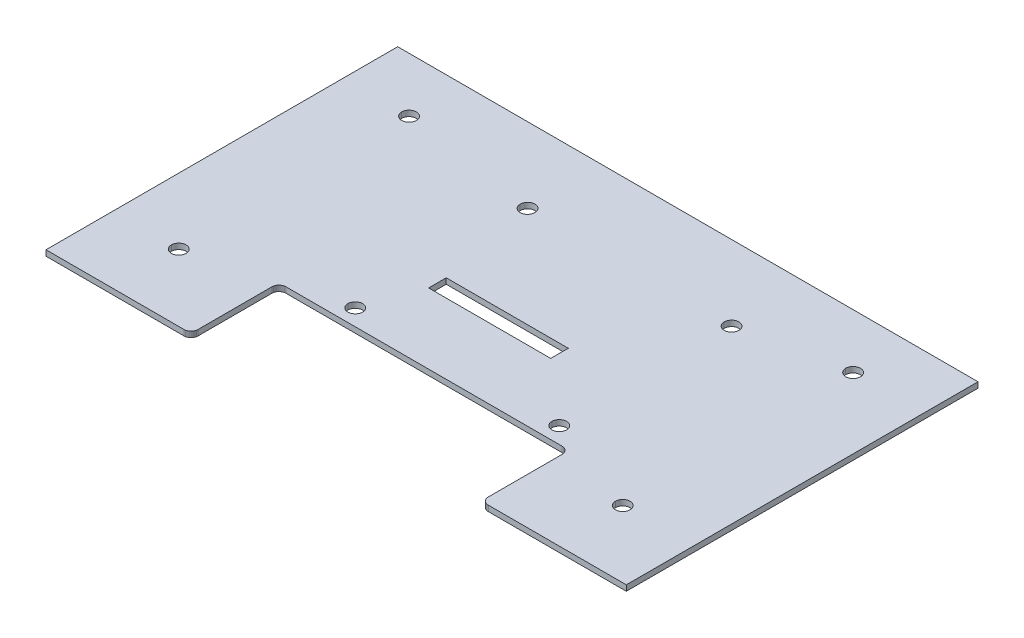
ISO-10303-21;
HEADER;
FILE_DESCRIPTION(('STEP AP214'),'2;1');
FILE_NAME('part.step','',(''),(''),'','','');
FILE_SCHEMA(('AUTOMOTIVE_DESIGN { 1 0 10303 214 1 1 1 1 }'));
ENDSEC;
DATA;
#1=APPLICATION_CONTEXT('core data for automotive mechanical design processes');
#2=APPLICATION_PROTOCOL_DEFINITION('international standard','automotive_design',2000,#1);
#3=PRODUCT_CONTEXT('',#1,'mechanical');
#4=PRODUCT('Part','Part','',(#3));
#5=PRODUCT_RELATED_PRODUCT_CATEGORY('part','',(#4));
#6=PRODUCT_DEFINITION_FORMATION('','',#4);
#7=PRODUCT_DEFINITION_CONTEXT('part definition',#1,'design');
#8=PRODUCT_DEFINITION('design','',#6,#7);
#9=PRODUCT_DEFINITION_SHAPE('','',#8);
#10=(LENGTH_UNIT() NAMED_UNIT(*) SI_UNIT(.MILLI.,.METRE.));
#11=(NAMED_UNIT(*) PLANE_ANGLE_UNIT() SI_UNIT($,.RADIAN.));
#12=(NAMED_UNIT(*) SI_UNIT($,.STERADIAN.) SOLID_ANGLE_UNIT());
#13=UNCERTAINTY_MEASURE_WITH_UNIT(LENGTH_MEASURE(1.E-05),#10,'distance_accuracy_value','');
#14=(GEOMETRIC_REPRESENTATION_CONTEXT(3) GLOBAL_UNCERTAINTY_ASSIGNED_CONTEXT((#13)) GLOBAL_UNIT_ASSIGNED_CONTEXT((#10,
#11,#12)) REPRESENTATION_CONTEXT('',''));
#15=CARTESIAN_POINT('',(0.,0.,0.));
#16=DIRECTION('',(0.,0.,1.));
#17=DIRECTION('',(1.,0.,0.));
#18=AXIS2_PLACEMENT_3D('',#15,#16,#17);
#19=CARTESIAN_POINT('',(35.7200071,-7.3,-13.07200068));
#20=DIRECTION('',(0.,0.,-1.));
#21=DIRECTION('',(0.,-1.,0.));
#22=AXIS2_PLACEMENT_3D('',#19,#20,#21);
#23=PLANE('',#22);
#24=DIRECTION('',(0.,-1.,0.));
#25=VECTOR('',#24,1.);
#26=CARTESIAN_POINT('',(40.9200071,-7.3,-13.07200068));
#27=LINE('',#26,#25);
#28=CARTESIAN_POINT('',(40.9200071,-7.3,-13.07200068));
#29=VERTEX_POINT('',#28);
#30=CARTESIAN_POINT('',(40.9200071,-9.8,-13.07200068));
#31=VERTEX_POINT('',#30);
#32=EDGE_CURVE('E11',#29,#31,#27,.T.);
#33=ORIENTED_EDGE('',*,*,#32,.T.);
#34=DIRECTION('',(1.,0.,0.));
#35=VECTOR('',#34,1.);
#36=CARTESIAN_POINT('',(35.7200071,-9.8,-13.07200068));
#37=LINE('',#36,#35);
#38=CARTESIAN_POINT('',(35.7200071,-9.8,-13.07200068));
#39=VERTEX_POINT('',#38);
#40=EDGE_CURVE('E1362',#39,#31,#37,.T.);
#41=ORIENTED_EDGE('',*,*,#40,.F.);
#42=DIRECTION('',(0.,-1.,0.));
#43=VECTOR('',#42,1.);
#44=CARTESIAN_POINT('',(35.7200071,-7.3,-13.07200068));
#45=LINE('',#44,#43);
#46=CARTESIAN_POINT('',(35.7200071,-7.3,-13.07200068));
#47=VERTEX_POINT('',#46);
#48=EDGE_CURVE('E1377',#47,#39,#45,.T.);
#49=ORIENTED_EDGE('',*,*,#48,.F.);
#50=DIRECTION('',(1.,0.,0.));
#51=VECTOR('',#50,1.);
#52=CARTESIAN_POINT('',(35.7200071,-7.3,-13.07200068));
#53=LINE('',#52,#51);
#54=EDGE_CURVE('E941',#47,#29,#53,.T.);
#55=ORIENTED_EDGE('',*,*,#54,.T.);
#56=EDGE_LOOP('',(#33,#41,#49,#55));
#57=FACE_BOUND('',#56,.T.);
#58=ADVANCED_FACE('F18',(#57),#23,.T.);
#59=CARTESIAN_POINT('',(40.9200071,-7.3,-13.07200068));
#60=DIRECTION('',(1.,0.,0.));
#61=DIRECTION('',(0.,1.,0.));
#62=AXIS2_PLACEMENT_3D('',#59,#60,#61);
#63=PLANE('',#62);
#64=DIRECTION('',(0.,-1.,0.));
#65=VECTOR('',#64,1.);
#66=CARTESIAN_POINT('',(40.9200071,-7.3,8.92799932));
#67=LINE('',#66,#65);
#68=CARTESIAN_POINT('',(40.9200071,-7.3,8.92799932));
#69=VERTEX_POINT('',#68);
#70=CARTESIAN_POINT('',(40.9200071,-9.8,8.92799932));
#71=VERTEX_POINT('',#70);
#72=EDGE_CURVE('E26',#69,#71,#67,.T.);
#73=ORIENTED_EDGE('',*,*,#72,.T.);
#74=DIRECTION('',(0.,0.,1.));
#75=VECTOR('',#74,1.);
#76=CARTESIAN_POINT('',(40.9200071,-9.8,-13.07200068));
#77=LINE('',#76,#75);
#78=EDGE_CURVE('E1366',#31,#71,#77,.T.);
#79=ORIENTED_EDGE('',*,*,#78,.F.);
#80=ORIENTED_EDGE('',*,*,#32,.F.);
#81=DIRECTION('',(0.,0.,1.));
#82=VECTOR('',#81,1.);
#83=CARTESIAN_POINT('',(40.9200071,-7.3,-13.07200068));
#84=LINE('',#83,#82);
#85=EDGE_CURVE('E1046',#29,#69,#84,.T.);
#86=ORIENTED_EDGE('',*,*,#85,.T.);
#87=EDGE_LOOP('',(#73,#79,#80,#86));
#88=FACE_BOUND('',#87,.T.);
#89=ADVANCED_FACE('F1902',(#88),#63,.T.);
#90=CARTESIAN_POINT('',(40.9200071,-7.3,8.92799932));
#91=DIRECTION('',(0.,0.,1.));
#92=DIRECTION('',(1.,0.,0.));
#93=AXIS2_PLACEMENT_3D('',#90,#91,#92);
#94=PLANE('',#93);
#95=DIRECTION('',(0.,-1.,0.));
#96=VECTOR('',#95,1.);
#97=CARTESIAN_POINT('',(35.7200071,-7.3,8.92799932));
#98=LINE('',#97,#96);
#99=CARTESIAN_POINT('',(35.7200071,-7.3,8.92799932));
#100=VERTEX_POINT('',#99);
#101=CARTESIAN_POINT('',(35.7200071,-9.8,8.92799932));
#102=VERTEX_POINT('',#101);
#103=EDGE_CURVE('E38',#100,#102,#98,.T.);
#104=ORIENTED_EDGE('',*,*,#103,.T.);
#105=DIRECTION('',(-1.,0.,0.));
#106=VECTOR('',#105,1.);
#107=CARTESIAN_POINT('',(40.9200071,-9.8,8.92799932));
#108=LINE('',#107,#106);
#109=EDGE_CURVE('E1247',#71,#102,#108,.T.);
#110=ORIENTED_EDGE('',*,*,#109,.F.);
#111=ORIENTED_EDGE('',*,*,#72,.F.);
#112=DIRECTION('',(-1.,0.,0.));
#113=VECTOR('',#112,1.);
#114=CARTESIAN_POINT('',(40.9200071,-7.3,8.92799932));
#115=LINE('',#114,#113);
#116=EDGE_CURVE('E1043',#69,#100,#115,.T.);
#117=ORIENTED_EDGE('',*,*,#116,.T.);
#118=EDGE_LOOP('',(#104,#110,#111,#117));
#119=FACE_BOUND('',#118,.T.);
#120=ADVANCED_FACE('F1799',(#119),#94,.T.);
#121=CARTESIAN_POINT('',(35.7200071,-7.3,8.92799932));
#122=DIRECTION('',(-1.,0.,0.));
#123=DIRECTION('',(0.,0.,1.));
#124=AXIS2_PLACEMENT_3D('',#121,#122,#123);
#125=PLANE('',#124);
#126=ORIENTED_EDGE('',*,*,#48,.T.);
#127=DIRECTION('',(0.,0.,-1.));
#128=VECTOR('',#127,1.);
#129=CARTESIAN_POINT('',(35.7200071,-9.8,8.92799932));
#130=LINE('',#129,#128);
#131=EDGE_CURVE('E1243',#102,#39,#130,.T.);
#132=ORIENTED_EDGE('',*,*,#131,.F.);
#133=ORIENTED_EDGE('',*,*,#103,.F.);
#134=DIRECTION('',(0.,0.,-1.));
#135=VECTOR('',#134,1.);
#136=CARTESIAN_POINT('',(35.7200071,-7.3,8.92799932));
#137=LINE('',#136,#135);
#138=EDGE_CURVE('E936',#100,#47,#137,.T.);
#139=ORIENTED_EDGE('',*,*,#138,.T.);
#140=EDGE_LOOP('',(#126,#132,#133,#139));
#141=FACE_BOUND('',#140,.T.);
#142=ADVANCED_FACE('F1772',(#141),#125,.T.);
#143=CARTESIAN_POINT('',(0.02000709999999,-7.3,9.73503512));
#144=DIRECTION('',(0.,0.,-1.));
#145=DIRECTION('',(0.,-1.,0.));
#146=AXIS2_PLACEMENT_3D('',#143,#144,#145);
#147=PLANE('',#146);
#148=DIRECTION('',(0.,-1.,0.));
#149=VECTOR('',#148,1.);
#150=CARTESIAN_POINT('',(8.0200071,-7.3,9.73503512));
#151=LINE('',#150,#149);
#152=CARTESIAN_POINT('',(8.0200071,-7.3,9.73503512));
#153=VERTEX_POINT('',#152);
#154=CARTESIAN_POINT('',(8.0200071,-9.8,9.73503512));
#155=VERTEX_POINT('',#154);
#156=EDGE_CURVE('E1374',#153,#155,#151,.T.);
#157=ORIENTED_EDGE('',*,*,#156,.T.);
#158=DIRECTION('',(1.,0.,0.));
#159=VECTOR('',#158,1.);
#160=CARTESIAN_POINT('',(0.02000709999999,-9.8,9.73503512));
#161=LINE('',#160,#159);
#162=CARTESIAN_POINT('',(0.02000709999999,-9.8,9.73503512));
#163=VERTEX_POINT('',#162);
#164=EDGE_CURVE('E1346',#163,#155,#161,.T.);
#165=ORIENTED_EDGE('',*,*,#164,.F.);
#166=DIRECTION('',(0.,-1.,0.));
#167=VECTOR('',#166,1.);
#168=CARTESIAN_POINT('',(0.02000709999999,-7.3,9.73503512));
#169=LINE('',#168,#167);
#170=CARTESIAN_POINT('',(0.02000709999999,-7.3,9.73503512));
#171=VERTEX_POINT('',#170);
#172=EDGE_CURVE('E822',#171,#163,#169,.T.);
#173=ORIENTED_EDGE('',*,*,#172,.F.);
#174=DIRECTION('',(1.,0.,0.));
#175=VECTOR('',#174,1.);
#176=CARTESIAN_POINT('',(0.02000709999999,-7.3,9.73503512));
#177=LINE('',#176,#175);
#178=EDGE_CURVE('E1013',#171,#153,#177,.T.);
#179=ORIENTED_EDGE('',*,*,#178,.T.);
#180=EDGE_LOOP('',(#157,#165,#173,#179));
#181=FACE_BOUND('',#180,.T.);
#182=ADVANCED_FACE('F1766',(#181),#147,.T.);
#183=CARTESIAN_POINT('',(8.0200071,-7.3,9.73503512));
#184=DIRECTION('',(1.,0.,0.));
#185=DIRECTION('',(0.,1.,0.));
#186=AXIS2_PLACEMENT_3D('',#183,#184,#185);
#187=PLANE('',#186);
#188=DIRECTION('',(0.,-1.,0.));
#189=VECTOR('',#188,1.);
#190=CARTESIAN_POINT('',(8.0200071,-7.3,14.73503512));
#191=LINE('',#190,#189);
#192=CARTESIAN_POINT('',(8.0200071,-7.3,14.73503512));
#193=VERTEX_POINT('',#192);
#194=CARTESIAN_POINT('',(8.0200071,-9.8,14.73503512));
#195=VERTEX_POINT('',#194);
#196=EDGE_CURVE('E821',#193,#195,#191,.T.);
#197=ORIENTED_EDGE('',*,*,#196,.T.);
#198=DIRECTION('',(0.,0.,1.));
#199=VECTOR('',#198,1.);
#200=CARTESIAN_POINT('',(8.0200071,-9.8,9.73503512));
#201=LINE('',#200,#199);
#202=EDGE_CURVE('E1350',#155,#195,#201,.T.);
#203=ORIENTED_EDGE('',*,*,#202,.F.);
#204=ORIENTED_EDGE('',*,*,#156,.F.);
#205=DIRECTION('',(0.,0.,1.));
#206=VECTOR('',#205,1.);
#207=CARTESIAN_POINT('',(8.0200071,-7.3,9.73503512));
#208=LINE('',#207,#206);
#209=EDGE_CURVE('E1009',#153,#193,#208,.T.);
#210=ORIENTED_EDGE('',*,*,#209,.T.);
#211=EDGE_LOOP('',(#197,#203,#204,#210));
#212=FACE_BOUND('',#211,.T.);
#213=ADVANCED_FACE('F1771',(#212),#187,.T.);
#214=CARTESIAN_POINT('',(8.0200071,-7.3,14.73503512));
#215=DIRECTION('',(0.,0.,1.));
#216=DIRECTION('',(1.,0.,0.));
#217=AXIS2_PLACEMENT_3D('',#214,#215,#216);
#218=PLANE('',#217);
#219=DIRECTION('',(0.,-1.,0.));
#220=VECTOR('',#219,1.);
#221=CARTESIAN_POINT('',(0.02000709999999,-7.3,14.73503512));
#222=LINE('',#221,#220);
#223=CARTESIAN_POINT('',(0.02000709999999,-7.3,14.73503512));
#224=VERTEX_POINT('',#223);
#225=CARTESIAN_POINT('',(0.02000709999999,-9.8,14.73503512));
#226=VERTEX_POINT('',#225);
#227=EDGE_CURVE('E818',#224,#226,#222,.T.);
#228=ORIENTED_EDGE('',*,*,#227,.T.);
#229=DIRECTION('',(-1.,0.,0.));
#230=VECTOR('',#229,1.);
#231=CARTESIAN_POINT('',(8.0200071,-9.8,14.73503512));
#232=LINE('',#231,#230);
#233=EDGE_CURVE('E1354',#195,#226,#232,.T.);
#234=ORIENTED_EDGE('',*,*,#233,.F.);
#235=ORIENTED_EDGE('',*,*,#196,.F.);
#236=DIRECTION('',(-1.,0.,0.));
#237=VECTOR('',#236,1.);
#238=CARTESIAN_POINT('',(8.0200071,-7.3,14.73503512));
#239=LINE('',#238,#237);
#240=EDGE_CURVE('E924',#193,#224,#239,.T.);
#241=ORIENTED_EDGE('',*,*,#240,.T.);
#242=EDGE_LOOP('',(#228,#234,#235,#241));
#243=FACE_BOUND('',#242,.T.);
#244=ADVANCED_FACE('F1574',(#243),#218,.T.);
#245=CARTESIAN_POINT('',(0.02000709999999,-7.3,14.73503512));
#246=DIRECTION('',(-1.,0.,0.));
#247=DIRECTION('',(0.,0.,1.));
#248=AXIS2_PLACEMENT_3D('',#245,#246,#247);
#249=PLANE('',#248);
#250=ORIENTED_EDGE('',*,*,#172,.T.);
#251=DIRECTION('',(0.,0.,-1.));
#252=VECTOR('',#251,1.);
#253=CARTESIAN_POINT('',(0.02000709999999,-9.8,14.73503512));
#254=LINE('',#253,#252);
#255=EDGE_CURVE('E1358',#226,#163,#254,.T.);
#256=ORIENTED_EDGE('',*,*,#255,.F.);
#257=ORIENTED_EDGE('',*,*,#227,.F.);
#258=DIRECTION('',(0.,0.,-1.));
#259=VECTOR('',#258,1.);
#260=CARTESIAN_POINT('',(0.02000709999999,-7.3,14.73503512));
#261=LINE('',#260,#259);
#262=EDGE_CURVE('E1039',#224,#171,#261,.T.);
#263=ORIENTED_EDGE('',*,*,#262,.T.);
#264=EDGE_LOOP('',(#250,#256,#257,#263));
#265=FACE_BOUND('',#264,.T.);
#266=ADVANCED_FACE('F1568',(#265),#249,.T.);
#267=CARTESIAN_POINT('',(0.,-9.8,0.));
#268=DIRECTION('',(0.,-1.,0.));
#269=DIRECTION('',(0.,0.,-1.));
#270=AXIS2_PLACEMENT_3D('',#267,#268,#269);
#271=PLANE('',#270);
#272=ORIENTED_EDGE('',*,*,#40,.T.);
#273=ORIENTED_EDGE('',*,*,#78,.T.);
#274=ORIENTED_EDGE('',*,*,#109,.T.);
#275=ORIENTED_EDGE('',*,*,#131,.T.);
#276=EDGE_LOOP('',(#272,#273,#274,#275));
#277=FACE_BOUND('',#276,.T.);
#278=ADVANCED_FACE('F1573',(#277),#271,.T.);
#279=CARTESIAN_POINT('',(0.,-9.8,0.));
#280=DIRECTION('',(0.,-1.,0.));
#281=DIRECTION('',(0.,0.,-1.));
#282=AXIS2_PLACEMENT_3D('',#279,#280,#281);
#283=PLANE('',#282);
#284=ORIENTED_EDGE('',*,*,#164,.T.);
#285=ORIENTED_EDGE('',*,*,#202,.T.);
#286=ORIENTED_EDGE('',*,*,#233,.T.);
#287=ORIENTED_EDGE('',*,*,#255,.T.);
#288=EDGE_LOOP('',(#284,#285,#286,#287));
#289=FACE_BOUND('',#288,.T.);
#290=ADVANCED_FACE('F2057',(#289),#283,.T.);
#291=CARTESIAN_POINT('',(0.,-9.8,0.));
#292=DIRECTION('',(0.,-1.,0.));
#293=DIRECTION('',(0.,0.,-1.));
#294=AXIS2_PLACEMENT_3D('',#291,#292,#293);
#295=PLANE('',#294);
#296=DIRECTION('',(1.,0.,0.));
#297=VECTOR('',#296,1.);
#298=CARTESIAN_POINT('',(-14.7799929,-9.8,-12.26501808));
#299=LINE('',#298,#297);
#300=CARTESIAN_POINT('',(-14.7799929,-9.8,-12.26501808));
#301=VERTEX_POINT('',#300);
#302=CARTESIAN_POINT('',(15.9200071,-9.8,-12.26501808));
#303=VERTEX_POINT('',#302);
#304=EDGE_CURVE('E1343',#301,#303,#299,.T.);
#305=ORIENTED_EDGE('',*,*,#304,.T.);
#306=DIRECTION('',(0.,0.,1.));
#307=VECTOR('',#306,1.);
#308=CARTESIAN_POINT('',(15.9200071,-9.8,-12.26501808));
#309=LINE('',#308,#307);
#310=CARTESIAN_POINT('',(15.9200071,-9.8,-7.26501808));
#311=VERTEX_POINT('',#310);
#312=EDGE_CURVE('E1073',#303,#311,#309,.T.);
#313=ORIENTED_EDGE('',*,*,#312,.T.);
#314=DIRECTION('',(-1.,0.,0.));
#315=VECTOR('',#314,1.);
#316=CARTESIAN_POINT('',(15.9200071,-9.8,-7.26501808));
#317=LINE('',#316,#315);
#318=CARTESIAN_POINT('',(-14.7799929,-9.8,-7.26501808));
#319=VERTEX_POINT('',#318);
#320=EDGE_CURVE('E1334',#311,#319,#317,.T.);
#321=ORIENTED_EDGE('',*,*,#320,.T.);
#322=DIRECTION('',(0.,0.,-1.));
#323=VECTOR('',#322,1.);
#324=CARTESIAN_POINT('',(-14.7799929,-9.8,-7.26501808));
#325=LINE('',#324,#323);
#326=EDGE_CURVE('E960',#319,#301,#325,.T.);
#327=ORIENTED_EDGE('',*,*,#326,.T.);
#328=EDGE_LOOP('',(#305,#313,#321,#327));
#329=FACE_BOUND('',#328,.T.);
#330=ADVANCED_FACE('F2047',(#329),#295,.T.);
#331=CARTESIAN_POINT('',(-14.7799929,-7.3,-12.26501808));
#332=DIRECTION('',(0.,0.,-1.));
#333=DIRECTION('',(0.,-1.,0.));
#334=AXIS2_PLACEMENT_3D('',#331,#332,#333);
#335=PLANE('',#334);
#336=DIRECTION('',(0.,-1.,0.));
#337=VECTOR('',#336,1.);
#338=CARTESIAN_POINT('',(15.9200071,-7.3,-12.26501808));
#339=LINE('',#338,#337);
#340=CARTESIAN_POINT('',(15.9200071,-7.3,-12.26501808));
#341=VERTEX_POINT('',#340);
#342=EDGE_CURVE('E1076',#341,#303,#339,.T.);
#343=ORIENTED_EDGE('',*,*,#342,.T.);
#344=ORIENTED_EDGE('',*,*,#304,.F.);
#345=DIRECTION('',(0.,-1.,0.));
#346=VECTOR('',#345,1.);
#347=CARTESIAN_POINT('',(-14.7799929,-7.3,-12.26501808));
#348=LINE('',#347,#346);
#349=CARTESIAN_POINT('',(-14.7799929,-7.3,-12.26501808));
#350=VERTEX_POINT('',#349);
#351=EDGE_CURVE('E965',#350,#301,#348,.T.);
#352=ORIENTED_EDGE('',*,*,#351,.F.);
#353=DIRECTION('',(1.,0.,0.));
#354=VECTOR('',#353,1.);
#355=CARTESIAN_POINT('',(-14.7799929,-7.3,-12.26501808));
#356=LINE('',#355,#354);
#357=EDGE_CURVE('E771',#350,#341,#356,.T.);
#358=ORIENTED_EDGE('',*,*,#357,.T.);
#359=EDGE_LOOP('',(#343,#344,#352,#358));
#360=FACE_BOUND('',#359,.T.);
#361=ADVANCED_FACE('F2037',(#360),#335,.T.);
#362=CARTESIAN_POINT('',(15.9200071,-7.3,-12.26501808));
#363=DIRECTION('',(1.,0.,0.));
#364=DIRECTION('',(0.,1.,0.));
#365=AXIS2_PLACEMENT_3D('',#362,#363,#364);
#366=PLANE('',#365);
#367=DIRECTION('',(0.,-1.,0.));
#368=VECTOR('',#367,1.);
#369=CARTESIAN_POINT('',(15.9200071,-7.3,-7.26501808));
#370=LINE('',#369,#368);
#371=CARTESIAN_POINT('',(15.9200071,-7.3,-7.26501808));
#372=VERTEX_POINT('',#371);
#373=EDGE_CURVE('E1077',#372,#311,#370,.T.);
#374=ORIENTED_EDGE('',*,*,#373,.T.);
#375=ORIENTED_EDGE('',*,*,#312,.F.);
#376=ORIENTED_EDGE('',*,*,#342,.F.);
#377=DIRECTION('',(0.,0.,1.));
#378=VECTOR('',#377,1.);
#379=CARTESIAN_POINT('',(15.9200071,-7.3,-12.26501808));
#380=LINE('',#379,#378);
#381=EDGE_CURVE('E776',#341,#372,#380,.T.);
#382=ORIENTED_EDGE('',*,*,#381,.T.);
#383=EDGE_LOOP('',(#374,#375,#376,#382));
#384=FACE_BOUND('',#383,.T.);
#385=ADVANCED_FACE('F2027',(#384),#366,.T.);
#386=CARTESIAN_POINT('',(15.9200071,-7.3,-7.26501808));
#387=DIRECTION('',(0.,0.,1.));
#388=DIRECTION('',(1.,0.,0.));
#389=AXIS2_PLACEMENT_3D('',#386,#387,#388);
#390=PLANE('',#389);
#391=DIRECTION('',(0.,-1.,0.));
#392=VECTOR('',#391,1.);
#393=CARTESIAN_POINT('',(-14.7799929,-7.3,-7.26501808));
#394=LINE('',#393,#392);
#395=CARTESIAN_POINT('',(-14.7799929,-7.3,-7.26501808));
#396=VERTEX_POINT('',#395);
#397=EDGE_CURVE('E964',#396,#319,#394,.T.);
#398=ORIENTED_EDGE('',*,*,#397,.T.);
#399=ORIENTED_EDGE('',*,*,#320,.F.);
#400=ORIENTED_EDGE('',*,*,#373,.F.);
#401=DIRECTION('',(-1.,0.,0.));
#402=VECTOR('',#401,1.);
#403=CARTESIAN_POINT('',(15.9200071,-7.3,-7.26501808));
#404=LINE('',#403,#402);
#405=EDGE_CURVE('E914',#372,#396,#404,.T.);
#406=ORIENTED_EDGE('',*,*,#405,.T.);
#407=EDGE_LOOP('',(#398,#399,#400,#406));
#408=FACE_BOUND('',#407,.T.);
#409=ADVANCED_FACE('F2017',(#408),#390,.T.);
#410=CARTESIAN_POINT('',(-14.7799929,-7.3,-7.26501808));
#411=DIRECTION('',(-1.,0.,0.));
#412=DIRECTION('',(0.,0.,1.));
#413=AXIS2_PLACEMENT_3D('',#410,#411,#412);
#414=PLANE('',#413);
#415=ORIENTED_EDGE('',*,*,#351,.T.);
#416=ORIENTED_EDGE('',*,*,#326,.F.);
#417=ORIENTED_EDGE('',*,*,#397,.F.);
#418=DIRECTION('',(0.,0.,-1.));
#419=VECTOR('',#418,1.);
#420=CARTESIAN_POINT('',(-14.7799929,-7.3,-7.26501808));
#421=LINE('',#420,#419);
#422=EDGE_CURVE('E775',#396,#350,#421,.T.);
#423=ORIENTED_EDGE('',*,*,#422,.T.);
#424=EDGE_LOOP('',(#415,#416,#417,#423));
#425=FACE_BOUND('',#424,.T.);
#426=ADVANCED_FACE('F2000',(#425),#414,.T.);
#427=CARTESIAN_POINT('',(17.7200071,-7.3,6.73503512));
#428=DIRECTION('',(0.,0.,1.));
#429=DIRECTION('',(1.,0.,0.));
#430=AXIS2_PLACEMENT_3D('',#427,#428,#429);
#431=PLANE('',#430);
#432=DIRECTION('',(0.,1.,0.));
#433=VECTOR('',#432,1.);
#434=CARTESIAN_POINT('',(-16.9799929,-7.3,6.73503512));
#435=LINE('',#434,#433);
#436=CARTESIAN_POINT('',(-16.9799929,-7.3,6.73503512));
#437=VERTEX_POINT('',#436);
#438=CARTESIAN_POINT('',(-16.9799929,-5.7,6.73503512));
#439=VERTEX_POINT('',#438);
#440=EDGE_CURVE('E1081',#437,#439,#435,.T.);
#441=ORIENTED_EDGE('',*,*,#440,.T.);
#442=DIRECTION('',(-1.,0.,0.));
#443=VECTOR('',#442,1.);
#444=CARTESIAN_POINT('',(17.7200071,-5.7,6.73503512));
#445=LINE('',#444,#443);
#446=CARTESIAN_POINT('',(17.7200071,-5.7,6.73503512));
#447=VERTEX_POINT('',#446);
#448=EDGE_CURVE('E999',#447,#439,#445,.T.);
#449=ORIENTED_EDGE('',*,*,#448,.F.);
#450=DIRECTION('',(0.,1.,0.));
#451=VECTOR('',#450,1.);
#452=CARTESIAN_POINT('',(17.7200071,-7.3,6.73503512));
#453=LINE('',#452,#451);
#454=CARTESIAN_POINT('',(17.7200071,-7.3,6.73503512));
#455=VERTEX_POINT('',#454);
#456=EDGE_CURVE('E1323',#455,#447,#453,.T.);
#457=ORIENTED_EDGE('',*,*,#456,.F.);
#458=DIRECTION('',(-1.,0.,0.));
#459=VECTOR('',#458,1.);
#460=CARTESIAN_POINT('',(17.7200071,-7.3,6.73503512));
#461=LINE('',#460,#459);
#462=EDGE_CURVE('E786',#455,#437,#461,.T.);
#463=ORIENTED_EDGE('',*,*,#462,.T.);
#464=EDGE_LOOP('',(#441,#449,#457,#463));
#465=FACE_BOUND('',#464,.T.);
#466=ADVANCED_FACE('F1991',(#465),#431,.F.);
#467=CARTESIAN_POINT('',(-16.9799929,-7.3,6.73503512));
#468=DIRECTION('',(-1.,0.,0.));
#469=DIRECTION('',(0.,0.,1.));
#470=AXIS2_PLACEMENT_3D('',#467,#468,#469);
#471=PLANE('',#470);
#472=DIRECTION('',(0.,1.,0.));
#473=VECTOR('',#472,1.);
#474=CARTESIAN_POINT('',(-16.9799929,-7.3,1.73503512));
#475=LINE('',#474,#473);
#476=CARTESIAN_POINT('',(-16.9799929,-7.3,1.73503512));
#477=VERTEX_POINT('',#476);
#478=CARTESIAN_POINT('',(-16.9799929,-5.7,1.73503512));
#479=VERTEX_POINT('',#478);
#480=EDGE_CURVE('E1084',#477,#479,#475,.T.);
#481=ORIENTED_EDGE('',*,*,#480,.T.);
#482=DIRECTION('',(0.,0.,-1.));
#483=VECTOR('',#482,1.);
#484=CARTESIAN_POINT('',(-16.9799929,-5.7,6.73503512));
#485=LINE('',#484,#483);
#486=EDGE_CURVE('E974',#439,#479,#485,.T.);
#487=ORIENTED_EDGE('',*,*,#486,.F.);
#488=ORIENTED_EDGE('',*,*,#440,.F.);
#489=DIRECTION('',(0.,0.,-1.));
#490=VECTOR('',#489,1.);
#491=CARTESIAN_POINT('',(-16.9799929,-7.3,6.73503512));
#492=LINE('',#491,#490);
#493=EDGE_CURVE('E791',#437,#477,#492,.T.);
#494=ORIENTED_EDGE('',*,*,#493,.T.);
#495=EDGE_LOOP('',(#481,#487,#488,#494));
#496=FACE_BOUND('',#495,.T.);
#497=ADVANCED_FACE('F1552',(#496),#471,.F.);
#498=CARTESIAN_POINT('',(-16.9799929,-7.3,1.73503512));
#499=DIRECTION('',(0.,0.,-1.));
#500=DIRECTION('',(0.,-1.,0.));
#501=AXIS2_PLACEMENT_3D('',#498,#499,#500);
#502=PLANE('',#501);
#503=DIRECTION('',(0.,1.,0.));
#504=VECTOR('',#503,1.);
#505=CARTESIAN_POINT('',(17.7200071,-7.3,1.73503512));
#506=LINE('',#505,#504);
#507=CARTESIAN_POINT('',(17.7200071,-7.3,1.73503512));
#508=VERTEX_POINT('',#507);
#509=CARTESIAN_POINT('',(17.7200071,-5.7,1.73503512));
#510=VERTEX_POINT('',#509);
#511=EDGE_CURVE('E1143',#508,#510,#506,.T.);
#512=ORIENTED_EDGE('',*,*,#511,.T.);
#513=DIRECTION('',(1.,0.,0.));
#514=VECTOR('',#513,1.);
#515=CARTESIAN_POINT('',(-16.9799929,-5.7,1.73503512));
#516=LINE('',#515,#514);
#517=EDGE_CURVE('E896',#479,#510,#516,.T.);
#518=ORIENTED_EDGE('',*,*,#517,.F.);
#519=ORIENTED_EDGE('',*,*,#480,.F.);
#520=DIRECTION('',(1.,0.,0.));
#521=VECTOR('',#520,1.);
#522=CARTESIAN_POINT('',(-16.9799929,-7.3,1.73503512));
#523=LINE('',#522,#521);
#524=EDGE_CURVE('E988',#477,#508,#523,.T.);
#525=ORIENTED_EDGE('',*,*,#524,.T.);
#526=EDGE_LOOP('',(#512,#518,#519,#525));
#527=FACE_BOUND('',#526,.T.);
#528=ADVANCED_FACE('F1546',(#527),#502,.F.);
#529=CARTESIAN_POINT('',(17.7200071,-7.3,1.73503512));
#530=DIRECTION('',(1.,0.,0.));
#531=DIRECTION('',(0.,1.,0.));
#532=AXIS2_PLACEMENT_3D('',#529,#530,#531);
#533=PLANE('',#532);
#534=ORIENTED_EDGE('',*,*,#456,.T.);
#535=DIRECTION('',(0.,0.,1.));
#536=VECTOR('',#535,1.);
#537=CARTESIAN_POINT('',(17.7200071,-5.7,1.73503512));
#538=LINE('',#537,#536);
#539=EDGE_CURVE('E892',#510,#447,#538,.T.);
#540=ORIENTED_EDGE('',*,*,#539,.F.);
#541=ORIENTED_EDGE('',*,*,#511,.F.);
#542=DIRECTION('',(0.,0.,1.));
#543=VECTOR('',#542,1.);
#544=CARTESIAN_POINT('',(17.7200071,-7.3,1.73503512));
#545=LINE('',#544,#543);
#546=EDGE_CURVE('E790',#508,#455,#545,.T.);
#547=ORIENTED_EDGE('',*,*,#546,.T.);
#548=EDGE_LOOP('',(#534,#540,#541,#547));
#549=FACE_BOUND('',#548,.T.);
#550=ADVANCED_FACE('F1551',(#549),#533,.F.);
#551=CARTESIAN_POINT('',(-80.7799677,-7.3,51.73498512));
#552=DIRECTION('',(-1.,0.,0.));
#553=DIRECTION('',(0.,0.,1.));
#554=AXIS2_PLACEMENT_3D('',#551,#552,#553);
#555=PLANE('',#554);
#556=DIRECTION('',(0.,1.,0.));
#557=VECTOR('',#556,1.);
#558=CARTESIAN_POINT('',(-80.7799677,-7.3,51.73498512));
#559=LINE('',#558,#557);
#560=CARTESIAN_POINT('',(-80.7799677,-7.3,51.73498512));
#561=VERTEX_POINT('',#560);
#562=CARTESIAN_POINT('',(-80.7799677,-5.7,51.73498512));
#563=VERTEX_POINT('',#562);
#564=EDGE_CURVE('E830',#561,#563,#559,.T.);
#565=ORIENTED_EDGE('',*,*,#564,.T.);
#566=DIRECTION('',(0.,0.,-1.));
#567=VECTOR('',#566,1.);
#568=CARTESIAN_POINT('',(-80.7799677,-5.7,51.73498512));
#569=LINE('',#568,#567);
#570=CARTESIAN_POINT('',(-80.7799677,-5.7,-48.26501808));
#571=VERTEX_POINT('',#570);
#572=EDGE_CURVE('E1068',#563,#571,#569,.T.);
#573=ORIENTED_EDGE('',*,*,#572,.T.);
#574=DIRECTION('',(0.,1.,0.));
#575=VECTOR('',#574,1.);
#576=CARTESIAN_POINT('',(-80.7799677,-7.3,-48.26501808));
#577=LINE('',#576,#575);
#578=CARTESIAN_POINT('',(-80.7799677,-7.3,-48.26501808));
#579=VERTEX_POINT('',#578);
#580=EDGE_CURVE('E1032',#579,#571,#577,.T.);
#581=ORIENTED_EDGE('',*,*,#580,.F.);
#582=DIRECTION('',(0.,0.,-1.));
#583=VECTOR('',#582,1.);
#584=CARTESIAN_POINT('',(-80.7799677,-7.3,51.73498512));
#585=LINE('',#584,#583);
#586=EDGE_CURVE('E737',#561,#579,#585,.T.);
#587=ORIENTED_EDGE('',*,*,#586,.F.);
#588=EDGE_LOOP('',(#565,#573,#581,#587));
#589=FACE_BOUND('',#588,.T.);
#590=ADVANCED_FACE('F1968',(#589),#555,.T.);
#591=CARTESIAN_POINT('',(-41.52705916,-7.3,51.74346618));
#592=DIRECTION('',(-0.000216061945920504,0.,0.999999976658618));
#593=DIRECTION('',(0.,1.,0.));
#594=AXIS2_PLACEMENT_3D('',#591,#592,#593);
#595=PLANE('',#594);
#596=DIRECTION('',(0.,1.,0.));
#597=VECTOR('',#596,1.);
#598=CARTESIAN_POINT('',(-41.52705916,-7.3,51.74346618));
#599=LINE('',#598,#597);
#600=CARTESIAN_POINT('',(-41.52705916,-7.3,51.74346618));
#601=VERTEX_POINT('',#600);
#602=CARTESIAN_POINT('',(-41.52705916,-5.7,51.74346618));
#603=VERTEX_POINT('',#602);
#604=EDGE_CURVE('E827',#601,#603,#599,.T.);
#605=ORIENTED_EDGE('',*,*,#604,.T.);
#606=DIRECTION('',(-0.999999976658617,0.,-0.000216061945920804));
#607=VECTOR('',#606,1.);
#608=CARTESIAN_POINT('',(-41.52705916,-5.7,51.74346618));
#609=LINE('',#608,#607);
#610=EDGE_CURVE('E1072',#603,#563,#609,.T.);
#611=ORIENTED_EDGE('',*,*,#610,.T.);
#612=ORIENTED_EDGE('',*,*,#564,.F.);
#613=DIRECTION('',(-0.999999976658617,0.,-0.000216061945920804));
#614=VECTOR('',#613,1.);
#615=CARTESIAN_POINT('',(-41.52705916,-7.3,51.74346618));
#616=LINE('',#615,#614);
#617=EDGE_CURVE('E869',#601,#561,#616,.T.);
#618=ORIENTED_EDGE('',*,*,#617,.F.);
#619=EDGE_LOOP('',(#605,#611,#612,#618));
#620=FACE_BOUND('',#619,.T.);
#621=ADVANCED_FACE('F1924',(#620),#595,.T.);
#622=CARTESIAN_POINT('',(-41.14792352,-7.3,51.7061231));
#623=DIRECTION('',(0.0980209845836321,0.,0.995184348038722));
#624=DIRECTION('',(0.,-1.,0.));
#625=AXIS2_PLACEMENT_3D('',#622,#623,#624);
#626=PLANE('',#625);
#627=DIRECTION('',(0.,1.,0.));
#628=VECTOR('',#627,1.);
#629=CARTESIAN_POINT('',(-41.14792352,-7.3,51.7061231));
#630=LINE('',#629,#628);
#631=CARTESIAN_POINT('',(-41.14792352,-7.3,51.7061231));
#632=VERTEX_POINT('',#631);
#633=CARTESIAN_POINT('',(-41.14792352,-5.7,51.7061231));
#634=VERTEX_POINT('',#633);
#635=EDGE_CURVE('E831',#632,#634,#630,.T.);
#636=ORIENTED_EDGE('',*,*,#635,.T.);
#637=DIRECTION('',(-0.995184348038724,0.,0.0980209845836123));
#638=VECTOR('',#637,1.);
#639=CARTESIAN_POINT('',(-41.14792352,-5.7,51.7061231));
#640=LINE('',#639,#638);
#641=EDGE_CURVE('E891',#634,#603,#640,.T.);
#642=ORIENTED_EDGE('',*,*,#641,.T.);
#643=ORIENTED_EDGE('',*,*,#604,.F.);
#644=DIRECTION('',(-0.995184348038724,0.,0.0980209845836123));
#645=VECTOR('',#644,1.);
#646=CARTESIAN_POINT('',(-41.14792352,-7.3,51.7061231));
#647=LINE('',#646,#645);
#648=EDGE_CURVE('E865',#632,#601,#647,.T.);
#649=ORIENTED_EDGE('',*,*,#648,.F.);
#650=EDGE_LOOP('',(#636,#642,#643,#649));
#651=FACE_BOUND('',#650,.T.);
#652=ADVANCED_FACE('F1919',(#651),#626,.T.);
#653=CARTESIAN_POINT('',(-40.77092148,-7.3,51.59176214));
#654=DIRECTION('',(0.290281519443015,0.,0.956941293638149));
#655=DIRECTION('',(0.,-1.,0.));
#656=AXIS2_PLACEMENT_3D('',#653,#654,#655);
#657=PLANE('',#656);
#658=DIRECTION('',(0.,1.,0.));
#659=VECTOR('',#658,1.);
#660=CARTESIAN_POINT('',(-40.77092148,-7.3,51.59176214));
#661=LINE('',#660,#659);
#662=CARTESIAN_POINT('',(-40.77092148,-7.3,51.59176214));
#663=VERTEX_POINT('',#662);
#664=CARTESIAN_POINT('',(-40.77092148,-5.7,51.59176214));
#665=VERTEX_POINT('',#664);
#666=EDGE_CURVE('E1254',#663,#665,#661,.T.);
#667=ORIENTED_EDGE('',*,*,#666,.T.);
#668=DIRECTION('',(-0.956941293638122,0.,0.290281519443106));
#669=VECTOR('',#668,1.);
#670=CARTESIAN_POINT('',(-40.77092148,-5.7,51.59176214));
#671=LINE('',#670,#669);
#672=EDGE_CURVE('E886',#665,#634,#671,.T.);
#673=ORIENTED_EDGE('',*,*,#672,.T.);
#674=ORIENTED_EDGE('',*,*,#635,.F.);
#675=DIRECTION('',(-0.956941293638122,0.,0.290281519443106));
#676=VECTOR('',#675,1.);
#677=CARTESIAN_POINT('',(-40.77092148,-7.3,51.59176214));
#678=LINE('',#677,#676);
#679=EDGE_CURVE('E861',#663,#632,#678,.T.);
#680=ORIENTED_EDGE('',*,*,#679,.F.);
#681=EDGE_LOOP('',(#667,#673,#674,#680));
#682=FACE_BOUND('',#681,.T.);
#683=ADVANCED_FACE('F1752',(#682),#657,.T.);
#684=CARTESIAN_POINT('',(-40.42347488,-7.3,51.4060475));
#685=DIRECTION('',(0.4713978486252,0.,0.8819206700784));
#686=DIRECTION('',(0.,-1.,0.));
#687=AXIS2_PLACEMENT_3D('',#684,#685,#686);
#688=PLANE('',#687);
#689=DIRECTION('',(0.,1.,0.));
#690=VECTOR('',#689,1.);
#691=CARTESIAN_POINT('',(-40.42347488,-7.3,51.4060475));
#692=LINE('',#691,#690);
#693=CARTESIAN_POINT('',(-40.42347488,-7.3,51.4060475));
#694=VERTEX_POINT('',#693);
#695=CARTESIAN_POINT('',(-40.42347488,-5.7,51.4060475));
#696=VERTEX_POINT('',#695);
#697=EDGE_CURVE('E1257',#694,#696,#692,.T.);
#698=ORIENTED_EDGE('',*,*,#697,.T.);
#699=DIRECTION('',(-0.8819206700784,0.,0.4713978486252));
#700=VECTOR('',#699,1.);
#701=CARTESIAN_POINT('',(-40.42347488,-5.7,51.4060475));
#702=LINE('',#701,#700);
#703=EDGE_CURVE('E890',#696,#665,#702,.T.);
#704=ORIENTED_EDGE('',*,*,#703,.T.);
#705=ORIENTED_EDGE('',*,*,#666,.F.);
#706=DIRECTION('',(-0.8819206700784,0.,0.4713978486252));
#707=VECTOR('',#706,1.);
#708=CARTESIAN_POINT('',(-40.42347488,-7.3,51.4060475));
#709=LINE('',#708,#707);
#710=EDGE_CURVE('E854',#694,#663,#709,.T.);
#711=ORIENTED_EDGE('',*,*,#710,.F.);
#712=EDGE_LOOP('',(#698,#704,#705,#711));
#713=FACE_BOUND('',#712,.T.);
#714=ADVANCED_FACE('F1746',(#713),#688,.T.);
#715=CARTESIAN_POINT('',(-40.1189365,-7.3,51.15611658));
#716=DIRECTION('',(0.63439742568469,0.,0.773007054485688));
#717=DIRECTION('',(0.,-1.,0.));
#718=AXIS2_PLACEMENT_3D('',#715,#716,#717);
#719=PLANE('',#718);
#720=DIRECTION('',(0.,1.,0.));
#721=VECTOR('',#720,1.);
#722=CARTESIAN_POINT('',(-40.1189365,-7.3,51.15611658));
#723=LINE('',#722,#721);
#724=CARTESIAN_POINT('',(-40.1189365,-7.3,51.15611658));
#725=VERTEX_POINT('',#724);
#726=CARTESIAN_POINT('',(-40.1189365,-5.7,51.15611658));
#727=VERTEX_POINT('',#726);
#728=EDGE_CURVE('E1314',#725,#727,#723,.T.);
#729=ORIENTED_EDGE('',*,*,#728,.T.);
#730=DIRECTION('',(-0.773007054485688,0.,0.63439742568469));
#731=VECTOR('',#730,1.);
#732=CARTESIAN_POINT('',(-40.1189365,-5.7,51.15611658));
#733=LINE('',#732,#731);
#734=EDGE_CURVE('E1091',#727,#696,#733,.T.);
#735=ORIENTED_EDGE('',*,*,#734,.T.);
#736=ORIENTED_EDGE('',*,*,#697,.F.);
#737=DIRECTION('',(-0.773007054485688,0.,0.63439742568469));
#738=VECTOR('',#737,1.);
#739=CARTESIAN_POINT('',(-40.1189365,-7.3,51.15611658));
#740=LINE('',#739,#738);
#741=EDGE_CURVE('E850',#725,#694,#740,.T.);
#742=ORIENTED_EDGE('',*,*,#741,.F.);
#743=EDGE_LOOP('',(#729,#735,#736,#742));
#744=FACE_BOUND('',#743,.T.);
#745=ADVANCED_FACE('F1751',(#744),#719,.T.);
#746=CARTESIAN_POINT('',(-39.86900558,-7.3,50.8515782));
#747=DIRECTION('',(0.773007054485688,0.,0.63439742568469));
#748=DIRECTION('',(0.,-1.,0.));
#749=AXIS2_PLACEMENT_3D('',#746,#747,#748);
#750=PLANE('',#749);
#751=DIRECTION('',(0.,1.,0.));
#752=VECTOR('',#751,1.);
#753=CARTESIAN_POINT('',(-39.86900558,-7.3,50.8515782));
#754=LINE('',#753,#752);
#755=CARTESIAN_POINT('',(-39.86900558,-7.3,50.8515782));
#756=VERTEX_POINT('',#755);
#757=CARTESIAN_POINT('',(-39.86900558,-5.7,50.8515782));
#758=VERTEX_POINT('',#757);
#759=EDGE_CURVE('E1311',#756,#758,#754,.T.);
#760=ORIENTED_EDGE('',*,*,#759,.T.);
#761=DIRECTION('',(-0.63439742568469,0.,0.773007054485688));
#762=VECTOR('',#761,1.);
#763=CARTESIAN_POINT('',(-39.86900558,-5.7,50.8515782));
#764=LINE('',#763,#762);
#765=EDGE_CURVE('E1095',#758,#727,#764,.T.);
#766=ORIENTED_EDGE('',*,*,#765,.T.);
#767=ORIENTED_EDGE('',*,*,#728,.F.);
#768=DIRECTION('',(-0.63439742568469,0.,0.773007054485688));
#769=VECTOR('',#768,1.);
#770=CARTESIAN_POINT('',(-39.86900558,-7.3,50.8515782));
#771=LINE('',#770,#769);
#772=EDGE_CURVE('E849',#756,#725,#771,.T.);
#773=ORIENTED_EDGE('',*,*,#772,.F.);
#774=EDGE_LOOP('',(#760,#766,#767,#773));
#775=FACE_BOUND('',#774,.T.);
#776=ADVANCED_FACE('F1461',(#775),#750,.T.);
#777=CARTESIAN_POINT('',(-39.68329094,-7.3,50.5041316));
#778=DIRECTION('',(0.8819206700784,0.,0.4713978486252));
#779=DIRECTION('',(0.,-1.,0.));
#780=AXIS2_PLACEMENT_3D('',#777,#778,#779);
#781=PLANE('',#780);
#782=DIRECTION('',(0.,1.,0.));
#783=VECTOR('',#782,1.);
#784=CARTESIAN_POINT('',(-39.68329094,-7.3,50.5041316));
#785=LINE('',#784,#783);
#786=CARTESIAN_POINT('',(-39.68329094,-7.3,50.5041316));
#787=VERTEX_POINT('',#786);
#788=CARTESIAN_POINT('',(-39.68329094,-5.7,50.5041316));
#789=VERTEX_POINT('',#788);
#790=EDGE_CURVE('E1308',#787,#789,#785,.T.);
#791=ORIENTED_EDGE('',*,*,#790,.T.);
#792=DIRECTION('',(-0.4713978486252,0.,0.8819206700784));
#793=VECTOR('',#792,1.);
#794=CARTESIAN_POINT('',(-39.68329094,-5.7,50.5041316));
#795=LINE('',#794,#793);
#796=EDGE_CURVE('E994',#789,#758,#795,.T.);
#797=ORIENTED_EDGE('',*,*,#796,.T.);
#798=ORIENTED_EDGE('',*,*,#759,.F.);
#799=DIRECTION('',(-0.4713978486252,0.,0.8819206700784));
#800=VECTOR('',#799,1.);
#801=CARTESIAN_POINT('',(-39.68329094,-7.3,50.5041316));
#802=LINE('',#801,#800);
#803=EDGE_CURVE('E845',#787,#756,#802,.T.);
#804=ORIENTED_EDGE('',*,*,#803,.F.);
#805=EDGE_LOOP('',(#791,#797,#798,#804));
#806=FACE_BOUND('',#805,.T.);
#807=ADVANCED_FACE('F1455',(#806),#781,.T.);
#808=CARTESIAN_POINT('',(-39.56892998,-7.3,50.12712956));
#809=DIRECTION('',(0.956941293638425,0.,0.290281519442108));
#810=DIRECTION('',(0.,-1.,0.));
#811=AXIS2_PLACEMENT_3D('',#808,#809,#810);
#812=PLANE('',#811);
#813=DIRECTION('',(0.,1.,0.));
#814=VECTOR('',#813,1.);
#815=CARTESIAN_POINT('',(-39.56892998,-7.3,50.12712956));
#816=LINE('',#815,#814);
#817=CARTESIAN_POINT('',(-39.56892998,-7.3,50.12712956));
#818=VERTEX_POINT('',#817);
#819=CARTESIAN_POINT('',(-39.56892998,-5.7,50.12712956));
#820=VERTEX_POINT('',#819);
#821=EDGE_CURVE('E1305',#818,#820,#816,.T.);
#822=ORIENTED_EDGE('',*,*,#821,.T.);
#823=DIRECTION('',(-0.290281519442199,0.,0.956941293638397));
#824=VECTOR('',#823,1.);
#825=CARTESIAN_POINT('',(-39.56892998,-5.7,50.12712956));
#826=LINE('',#825,#824);
#827=EDGE_CURVE('E989',#820,#789,#826,.T.);
#828=ORIENTED_EDGE('',*,*,#827,.T.);
#829=ORIENTED_EDGE('',*,*,#790,.F.);
#830=DIRECTION('',(-0.290281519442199,0.,0.956941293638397));
#831=VECTOR('',#830,1.);
#832=CARTESIAN_POINT('',(-39.56892998,-7.3,50.12712956));
#833=LINE('',#832,#831);
#834=EDGE_CURVE('E841',#818,#787,#833,.T.);
#835=ORIENTED_EDGE('',*,*,#834,.F.);
#836=EDGE_LOOP('',(#822,#828,#829,#835));
#837=FACE_BOUND('',#836,.T.);
#838=ADVANCED_FACE('F1460',(#837),#812,.T.);
#839=CARTESIAN_POINT('',(-39.5400197,-7.3,49.73646232));
#840=DIRECTION('',(0.997273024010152,0.,0.0738005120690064));
#841=DIRECTION('',(0.,-1.,0.));
#842=AXIS2_PLACEMENT_3D('',#839,#840,#841);
#843=PLANE('',#842);
#844=DIRECTION('',(0.,1.,0.));
#845=VECTOR('',#844,1.);
#846=CARTESIAN_POINT('',(-39.5400197,-7.3,49.73646232));
#847=LINE('',#846,#845);
#848=CARTESIAN_POINT('',(-39.5400197,-7.3,49.73646232));
#849=VERTEX_POINT('',#848);
#850=CARTESIAN_POINT('',(-39.5400197,-5.7,49.73646232));
#851=VERTEX_POINT('',#850);
#852=EDGE_CURVE('E1294',#849,#851,#847,.T.);
#853=ORIENTED_EDGE('',*,*,#852,.T.);
#854=DIRECTION('',(-0.0738005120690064,0.,0.997273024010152));
#855=VECTOR('',#854,1.);
#856=CARTESIAN_POINT('',(-39.5400197,-5.7,49.73646232));
#857=LINE('',#856,#855);
#858=EDGE_CURVE('E993',#851,#820,#857,.T.);
#859=ORIENTED_EDGE('',*,*,#858,.T.);
#860=ORIENTED_EDGE('',*,*,#821,.F.);
#861=DIRECTION('',(-0.0738005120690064,0.,0.997273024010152));
#862=VECTOR('',#861,1.);
#863=CARTESIAN_POINT('',(-39.5400197,-7.3,49.73646232));
#864=LINE('',#863,#862);
#865=EDGE_CURVE('E826',#849,#818,#864,.T.);
#866=ORIENTED_EDGE('',*,*,#865,.F.);
#867=EDGE_LOOP('',(#853,#859,#860,#866));
#868=FACE_BOUND('',#867,.T.);
#869=ADVANCED_FACE('F1512',(#868),#843,.T.);
#870=CARTESIAN_POINT('',(-39.54843726,-7.3,28.72352492));
#871=DIRECTION('',(0.999999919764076,0.,-0.00040058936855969));
#872=DIRECTION('',(0.,-1.,0.));
#873=AXIS2_PLACEMENT_3D('',#870,#871,#872);
#874=PLANE('',#873);
#875=DIRECTION('',(0.,1.,0.));
#876=VECTOR('',#875,1.);
#877=CARTESIAN_POINT('',(-39.54843726,-7.3,28.72352492));
#878=LINE('',#877,#876);
#879=CARTESIAN_POINT('',(-39.54843726,-7.3,28.72352492));
#880=VERTEX_POINT('',#879);
#881=CARTESIAN_POINT('',(-39.54843726,-5.7,28.72352492));
#882=VERTEX_POINT('',#881);
#883=EDGE_CURVE('E1291',#880,#882,#878,.T.);
#884=ORIENTED_EDGE('',*,*,#883,.T.);
#885=DIRECTION('',(0.00040058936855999,0.,0.999999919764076));
#886=VECTOR('',#885,1.);
#887=CARTESIAN_POINT('',(-39.54843726,-5.7,28.72352492));
#888=LINE('',#887,#886);
#889=EDGE_CURVE('E920',#882,#851,#888,.T.);
#890=ORIENTED_EDGE('',*,*,#889,.T.);
#891=ORIENTED_EDGE('',*,*,#852,.F.);
#892=DIRECTION('',(0.00040058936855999,0.,0.999999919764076));
#893=VECTOR('',#892,1.);
#894=CARTESIAN_POINT('',(-39.54843726,-7.3,28.72352492));
#895=LINE('',#894,#893);
#896=EDGE_CURVE('E811',#880,#849,#895,.T.);
#897=ORIENTED_EDGE('',*,*,#896,.F.);
#898=EDGE_LOOP('',(#884,#890,#891,#897));
#899=FACE_BOUND('',#898,.T.);
#900=ADVANCED_FACE('F1506',(#899),#874,.T.);
#901=CARTESIAN_POINT('',(-39.51109418,-7.3,28.34438928));
#902=DIRECTION('',(0.995184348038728,0.,0.0980209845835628));
#903=DIRECTION('',(0.,-1.,0.));
#904=AXIS2_PLACEMENT_3D('',#901,#902,#903);
#905=PLANE('',#904);
#906=DIRECTION('',(0.,1.,0.));
#907=VECTOR('',#906,1.);
#908=CARTESIAN_POINT('',(-39.51109418,-7.3,28.34438928));
#909=LINE('',#908,#907);
#910=CARTESIAN_POINT('',(-39.51109418,-7.3,28.34438928));
#911=VERTEX_POINT('',#910);
#912=CARTESIAN_POINT('',(-39.51109418,-5.7,28.34438928));
#913=VERTEX_POINT('',#912);
#914=EDGE_CURVE('E1295',#911,#913,#909,.T.);
#915=ORIENTED_EDGE('',*,*,#914,.T.);
#916=DIRECTION('',(-0.0980209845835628,0.,0.995184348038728));
#917=VECTOR('',#916,1.);
#918=CARTESIAN_POINT('',(-39.51109418,-5.7,28.34438928));
#919=LINE('',#918,#917);
#920=EDGE_CURVE('E915',#913,#882,#919,.T.);
#921=ORIENTED_EDGE('',*,*,#920,.T.);
#922=ORIENTED_EDGE('',*,*,#883,.F.);
#923=DIRECTION('',(-0.0980209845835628,0.,0.995184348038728));
#924=VECTOR('',#923,1.);
#925=CARTESIAN_POINT('',(-39.51109418,-7.3,28.34438928));
#926=LINE('',#925,#924);
#927=EDGE_CURVE('E807',#911,#880,#926,.T.);
#928=ORIENTED_EDGE('',*,*,#927,.F.);
#929=EDGE_LOOP('',(#915,#921,#922,#928));
#930=FACE_BOUND('',#929,.T.);
#931=ADVANCED_FACE('F1511',(#930),#905,.T.);
#932=CARTESIAN_POINT('',(-39.39673322,-7.3,27.96738724));
#933=DIRECTION('',(0.956941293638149,0.,0.290281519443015));
#934=DIRECTION('',(0.,-1.,0.));
#935=AXIS2_PLACEMENT_3D('',#932,#933,#934);
#936=PLANE('',#935);
#937=DIRECTION('',(0.,1.,0.));
#938=VECTOR('',#937,1.);
#939=CARTESIAN_POINT('',(-39.39673322,-7.3,27.96738724));
#940=LINE('',#939,#938);
#941=CARTESIAN_POINT('',(-39.39673322,-7.3,27.96738724));
#942=VERTEX_POINT('',#941);
#943=CARTESIAN_POINT('',(-39.39673322,-5.7,27.96738724));
#944=VERTEX_POINT('',#943);
#945=EDGE_CURVE('E1298',#942,#944,#940,.T.);
#946=ORIENTED_EDGE('',*,*,#945,.T.);
#947=DIRECTION('',(-0.290281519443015,0.,0.956941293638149));
#948=VECTOR('',#947,1.);
#949=CARTESIAN_POINT('',(-39.39673322,-5.7,27.96738724));
#950=LINE('',#949,#948);
#951=EDGE_CURVE('E919',#944,#913,#950,.T.);
#952=ORIENTED_EDGE('',*,*,#951,.T.);
#953=ORIENTED_EDGE('',*,*,#914,.F.);
#954=DIRECTION('',(-0.290281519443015,0.,0.956941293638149));
#955=VECTOR('',#954,1.);
#956=CARTESIAN_POINT('',(-39.39673322,-7.3,27.96738724));
#957=LINE('',#956,#955);
#958=EDGE_CURVE('E803',#942,#911,#957,.T.);
#959=ORIENTED_EDGE('',*,*,#958,.F.);
#960=EDGE_LOOP('',(#946,#952,#953,#959));
#961=FACE_BOUND('',#960,.T.);
#962=ADVANCED_FACE('F1889',(#961),#936,.T.);
#963=CARTESIAN_POINT('',(-39.21101858,-7.3,27.61994064));
#964=DIRECTION('',(0.8819206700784,0.,0.4713978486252));
#965=DIRECTION('',(0.,-1.,0.));
#966=AXIS2_PLACEMENT_3D('',#963,#964,#965);
#967=PLANE('',#966);
#968=DIRECTION('',(0.,1.,0.));
#969=VECTOR('',#968,1.);
#970=CARTESIAN_POINT('',(-39.21101858,-7.3,27.61994064));
#971=LINE('',#970,#969);
#972=CARTESIAN_POINT('',(-39.21101858,-7.3,27.61994064));
#973=VERTEX_POINT('',#972);
#974=CARTESIAN_POINT('',(-39.21101858,-5.7,27.61994064));
#975=VERTEX_POINT('',#974);
#976=EDGE_CURVE('E1290',#973,#975,#971,.T.);
#977=ORIENTED_EDGE('',*,*,#976,.T.);
#978=DIRECTION('',(-0.4713978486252,0.,0.8819206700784));
#979=VECTOR('',#978,1.);
#980=CARTESIAN_POINT('',(-39.21101858,-5.7,27.61994064));
#981=LINE('',#980,#979);
#982=EDGE_CURVE('E662',#975,#944,#981,.T.);
#983=ORIENTED_EDGE('',*,*,#982,.T.);
#984=ORIENTED_EDGE('',*,*,#945,.F.);
#985=DIRECTION('',(-0.4713978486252,0.,0.8819206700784));
#986=VECTOR('',#985,1.);
#987=CARTESIAN_POINT('',(-39.21101858,-7.3,27.61994064));
#988=LINE('',#987,#986);
#989=EDGE_CURVE('E799',#973,#942,#988,.T.);
#990=ORIENTED_EDGE('',*,*,#989,.F.);
#991=EDGE_LOOP('',(#977,#983,#984,#990));
#992=FACE_BOUND('',#991,.T.);
#993=ADVANCED_FACE('F1624',(#992),#967,.T.);
#994=CARTESIAN_POINT('',(-38.96108766,-7.3,27.31540226));
#995=DIRECTION('',(0.773007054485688,0.,0.63439742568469));
#996=DIRECTION('',(0.,-1.,0.));
#997=AXIS2_PLACEMENT_3D('',#994,#995,#996);
#998=PLANE('',#997);
#999=DIRECTION('',(0.,1.,0.));
#1000=VECTOR('',#999,1.);
#1001=CARTESIAN_POINT('',(-38.96108766,-7.3,27.31540226));
#1002=LINE('',#1001,#1000);
#1003=CARTESIAN_POINT('',(-38.96108766,-7.3,27.31540226));
#1004=VERTEX_POINT('',#1003);
#1005=CARTESIAN_POINT('',(-38.96108766,-5.7,27.31540226));
#1006=VERTEX_POINT('',#1005);
#1007=EDGE_CURVE('E1287',#1004,#1006,#1002,.T.);
#1008=ORIENTED_EDGE('',*,*,#1007,.T.);
#1009=DIRECTION('',(-0.63439742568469,0.,0.773007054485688));
#1010=VECTOR('',#1009,1.);
#1011=CARTESIAN_POINT('',(-38.96108766,-5.7,27.31540226));
#1012=LINE('',#1011,#1010);
#1013=EDGE_CURVE('E657',#1006,#975,#1012,.T.);
#1014=ORIENTED_EDGE('',*,*,#1013,.T.);
#1015=ORIENTED_EDGE('',*,*,#976,.F.);
#1016=DIRECTION('',(-0.63439742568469,0.,0.773007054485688));
#1017=VECTOR('',#1016,1.);
#1018=CARTESIAN_POINT('',(-38.96108766,-7.3,27.31540226));
#1019=LINE('',#1018,#1017);
#1020=EDGE_CURVE('E795',#1004,#973,#1019,.T.);
#1021=ORIENTED_EDGE('',*,*,#1020,.F.);
#1022=EDGE_LOOP('',(#1008,#1014,#1015,#1021));
#1023=FACE_BOUND('',#1022,.T.);
#1024=ADVANCED_FACE('F1618',(#1023),#998,.T.);
#1025=CARTESIAN_POINT('',(-38.65654928,-7.3,27.06547134));
#1026=DIRECTION('',(0.634397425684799,0.,0.773007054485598));
#1027=DIRECTION('',(0.,-1.,0.));
#1028=AXIS2_PLACEMENT_3D('',#1025,#1026,#1027);
#1029=PLANE('',#1028);
#1030=DIRECTION('',(0.,1.,0.));
#1031=VECTOR('',#1030,1.);
#1032=CARTESIAN_POINT('',(-38.65654928,-7.3,27.06547134));
#1033=LINE('',#1032,#1031);
#1034=CARTESIAN_POINT('',(-38.65654928,-7.3,27.06547134));
#1035=VERTEX_POINT('',#1034);
#1036=CARTESIAN_POINT('',(-38.65654928,-5.7,27.06547134));
#1037=VERTEX_POINT('',#1036);
#1038=EDGE_CURVE('E1286',#1035,#1037,#1033,.T.);
#1039=ORIENTED_EDGE('',*,*,#1038,.T.);
#1040=DIRECTION('',(-0.773007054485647,0.,0.634397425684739));
#1041=VECTOR('',#1040,1.);
#1042=CARTESIAN_POINT('',(-38.65654928,-5.7,27.06547134));
#1043=LINE('',#1042,#1041);
#1044=EDGE_CURVE('E661',#1037,#1006,#1043,.T.);
#1045=ORIENTED_EDGE('',*,*,#1044,.T.);
#1046=ORIENTED_EDGE('',*,*,#1007,.F.);
#1047=DIRECTION('',(-0.773007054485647,0.,0.634397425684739));
#1048=VECTOR('',#1047,1.);
#1049=CARTESIAN_POINT('',(-38.65654928,-7.3,27.06547134));
#1050=LINE('',#1049,#1048);
#1051=EDGE_CURVE('E785',#1035,#1004,#1050,.T.);
#1052=ORIENTED_EDGE('',*,*,#1051,.F.);
#1053=EDGE_LOOP('',(#1039,#1045,#1046,#1052));
#1054=FACE_BOUND('',#1053,.T.);
#1055=ADVANCED_FACE('F1623',(#1054),#1029,.T.);
#1056=CARTESIAN_POINT('',(-38.30910268,-7.3,26.8797567));
#1057=DIRECTION('',(0.4713978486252,0.,0.8819206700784));
#1058=DIRECTION('',(0.,-1.,0.));
#1059=AXIS2_PLACEMENT_3D('',#1056,#1057,#1058);
#1060=PLANE('',#1059);
#1061=DIRECTION('',(0.,1.,0.));
#1062=VECTOR('',#1061,1.);
#1063=CARTESIAN_POINT('',(-38.30910268,-7.3,26.8797567));
#1064=LINE('',#1063,#1062);
#1065=CARTESIAN_POINT('',(-38.30910268,-7.3,26.8797567));
#1066=VERTEX_POINT('',#1065);
#1067=CARTESIAN_POINT('',(-38.30910268,-5.7,26.8797567));
#1068=VERTEX_POINT('',#1067);
#1069=EDGE_CURVE('E1283',#1066,#1068,#1064,.T.);
#1070=ORIENTED_EDGE('',*,*,#1069,.T.);
#1071=DIRECTION('',(-0.8819206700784,0.,0.4713978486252));
#1072=VECTOR('',#1071,1.);
#1073=CARTESIAN_POINT('',(-38.30910268,-5.7,26.8797567));
#1074=LINE('',#1073,#1072);
#1075=EDGE_CURVE('E1020',#1068,#1037,#1074,.T.);
#1076=ORIENTED_EDGE('',*,*,#1075,.T.);
#1077=ORIENTED_EDGE('',*,*,#1038,.F.);
#1078=DIRECTION('',(-0.8819206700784,0.,0.4713978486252));
#1079=VECTOR('',#1078,1.);
#1080=CARTESIAN_POINT('',(-38.30910268,-7.3,26.8797567));
#1081=LINE('',#1080,#1079);
#1082=EDGE_CURVE('E770',#1066,#1035,#1081,.T.);
#1083=ORIENTED_EDGE('',*,*,#1082,.F.);
#1084=EDGE_LOOP('',(#1070,#1076,#1077,#1083));
#1085=FACE_BOUND('',#1084,.T.);
#1086=ADVANCED_FACE('F1866',(#1085),#1060,.T.);
#1087=CARTESIAN_POINT('',(-37.93210064,-7.3,26.76539574));
#1088=DIRECTION('',(0.290281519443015,0.,0.956941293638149));
#1089=DIRECTION('',(0.,-1.,0.));
#1090=AXIS2_PLACEMENT_3D('',#1087,#1088,#1089);
#1091=PLANE('',#1090);
#1092=DIRECTION('',(0.,1.,0.));
#1093=VECTOR('',#1092,1.);
#1094=CARTESIAN_POINT('',(-37.93210064,-7.3,26.76539574));
#1095=LINE('',#1094,#1093);
#1096=CARTESIAN_POINT('',(-37.93210064,-7.3,26.76539574));
#1097=VERTEX_POINT('',#1096);
#1098=CARTESIAN_POINT('',(-37.93210064,-5.7,26.76539574));
#1099=VERTEX_POINT('',#1098);
#1100=EDGE_CURVE('E1280',#1097,#1099,#1095,.T.);
#1101=ORIENTED_EDGE('',*,*,#1100,.T.);
#1102=DIRECTION('',(-0.956941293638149,0.,0.290281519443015));
#1103=VECTOR('',#1102,1.);
#1104=CARTESIAN_POINT('',(-37.93210064,-5.7,26.76539574));
#1105=LINE('',#1104,#1103);
#1106=EDGE_CURVE('E1024',#1099,#1068,#1105,.T.);
#1107=ORIENTED_EDGE('',*,*,#1106,.T.);
#1108=ORIENTED_EDGE('',*,*,#1069,.F.);
#1109=DIRECTION('',(-0.956941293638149,0.,0.290281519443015));
#1110=VECTOR('',#1109,1.);
#1111=CARTESIAN_POINT('',(-37.93210064,-7.3,26.76539574));
#1112=LINE('',#1111,#1110);
#1113=EDGE_CURVE('E766',#1097,#1066,#1112,.T.);
#1114=ORIENTED_EDGE('',*,*,#1113,.F.);
#1115=EDGE_LOOP('',(#1101,#1107,#1108,#1114));
#1116=FACE_BOUND('',#1115,.T.);
#1117=ADVANCED_FACE('F1857',(#1116),#1091,.T.);
#1118=CARTESIAN_POINT('',(-37.5414461,-7.3,26.73503512));
#1119=DIRECTION('',(0.0774836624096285,0.,0.99699362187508));
#1120=DIRECTION('',(0.,-1.,0.));
#1121=AXIS2_PLACEMENT_3D('',#1118,#1119,#1120);
#1122=PLANE('',#1121);
#1123=DIRECTION('',(0.,1.,0.));
#1124=VECTOR('',#1123,1.);
#1125=CARTESIAN_POINT('',(-37.5414461,-7.3,26.73503512));
#1126=LINE('',#1125,#1124);
#1127=CARTESIAN_POINT('',(-37.5414461,-7.3,26.73503512));
#1128=VERTEX_POINT('',#1127);
#1129=CARTESIAN_POINT('',(-37.5414461,-5.7,26.73503512));
#1130=VERTEX_POINT('',#1129);
#1131=EDGE_CURVE('E1277',#1128,#1130,#1126,.T.);
#1132=ORIENTED_EDGE('',*,*,#1131,.T.);
#1133=DIRECTION('',(-0.996993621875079,0.,0.0774836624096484));
#1134=VECTOR('',#1133,1.);
#1135=CARTESIAN_POINT('',(-37.5414461,-5.7,26.73503512));
#1136=LINE('',#1135,#1134);
#1137=EDGE_CURVE('E1120',#1130,#1099,#1136,.T.);
#1138=ORIENTED_EDGE('',*,*,#1137,.T.);
#1139=ORIENTED_EDGE('',*,*,#1100,.F.);
#1140=DIRECTION('',(-0.996993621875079,0.,0.0774836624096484));
#1141=VECTOR('',#1140,1.);
#1142=CARTESIAN_POINT('',(-37.5414461,-7.3,26.73503512));
#1143=LINE('',#1142,#1141);
#1144=EDGE_CURVE('E752',#1128,#1097,#1143,.T.);
#1145=ORIENTED_EDGE('',*,*,#1144,.F.);
#1146=EDGE_LOOP('',(#1132,#1138,#1139,#1145));
#1147=FACE_BOUND('',#1146,.T.);
#1148=ADVANCED_FACE('F1848',(#1147),#1122,.T.);
#1149=CARTESIAN_POINT('',(40.99296884,-7.3,26.72799932));
#1150=DIRECTION('',(8.95887487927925E-05,0.,0.999999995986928));
#1151=DIRECTION('',(0.,-1.,0.));
#1152=AXIS2_PLACEMENT_3D('',#1149,#1150,#1151);
#1153=PLANE('',#1152);
#1154=DIRECTION('',(0.,1.,0.));
#1155=VECTOR('',#1154,1.);
#1156=CARTESIAN_POINT('',(40.99296884,-7.3,26.72799932));
#1157=LINE('',#1156,#1155);
#1158=CARTESIAN_POINT('',(40.99296884,-7.3,26.72799932));
#1159=VERTEX_POINT('',#1158);
#1160=CARTESIAN_POINT('',(40.99296884,-5.7,26.72799932));
#1161=VERTEX_POINT('',#1160);
#1162=EDGE_CURVE('E1229',#1159,#1161,#1157,.T.);
#1163=ORIENTED_EDGE('',*,*,#1162,.T.);
#1164=DIRECTION('',(-0.999999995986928,0.,8.95887487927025E-05));
#1165=VECTOR('',#1164,1.);
#1166=CARTESIAN_POINT('',(40.99296884,-5.7,26.72799932));
#1167=LINE('',#1166,#1165);
#1168=EDGE_CURVE('E1127',#1161,#1130,#1167,.T.);
#1169=ORIENTED_EDGE('',*,*,#1168,.T.);
#1170=ORIENTED_EDGE('',*,*,#1131,.F.);
#1171=DIRECTION('',(-0.999999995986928,0.,8.95887487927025E-05));
#1172=VECTOR('',#1171,1.);
#1173=CARTESIAN_POINT('',(40.99296884,-7.3,26.72799932));
#1174=LINE('',#1173,#1172);
#1175=EDGE_CURVE('E741',#1159,#1128,#1174,.T.);
#1176=ORIENTED_EDGE('',*,*,#1175,.F.);
#1177=EDGE_LOOP('',(#1163,#1169,#1170,#1176));
#1178=FACE_BOUND('',#1177,.T.);
#1179=ADVANCED_FACE('F1832',(#1178),#1153,.T.);
#1180=CARTESIAN_POINT('',(41.37210448,-7.3,26.7653424));
#1181=DIRECTION('',(-0.0980209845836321,0.,0.995184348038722));
#1182=DIRECTION('',(0.,1.,0.));
#1183=AXIS2_PLACEMENT_3D('',#1180,#1181,#1182);
#1184=PLANE('',#1183);
#1185=DIRECTION('',(0.,1.,0.));
#1186=VECTOR('',#1185,1.);
#1187=CARTESIAN_POINT('',(41.37210448,-7.3,26.7653424));
#1188=LINE('',#1187,#1186);
#1189=CARTESIAN_POINT('',(41.37210448,-7.3,26.7653424));
#1190=VERTEX_POINT('',#1189);
#1191=CARTESIAN_POINT('',(41.37210448,-5.7,26.7653424));
#1192=VERTEX_POINT('',#1191);
#1193=EDGE_CURVE('E1226',#1190,#1192,#1188,.T.);
#1194=ORIENTED_EDGE('',*,*,#1193,.T.);
#1195=DIRECTION('',(-0.995184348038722,0.,-0.0980209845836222));
#1196=VECTOR('',#1195,1.);
#1197=CARTESIAN_POINT('',(41.37210448,-5.7,26.7653424));
#1198=LINE('',#1197,#1196);
#1199=EDGE_CURVE('E970',#1192,#1161,#1198,.T.);
#1200=ORIENTED_EDGE('',*,*,#1199,.T.);
#1201=ORIENTED_EDGE('',*,*,#1162,.F.);
#1202=DIRECTION('',(-0.995184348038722,0.,-0.0980209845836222));
#1203=VECTOR('',#1202,1.);
#1204=CARTESIAN_POINT('',(41.37210448,-7.3,26.7653424));
#1205=LINE('',#1204,#1203);
#1206=EDGE_CURVE('E732',#1190,#1159,#1205,.T.);
#1207=ORIENTED_EDGE('',*,*,#1206,.F.);
#1208=EDGE_LOOP('',(#1194,#1200,#1201,#1207));
#1209=FACE_BOUND('',#1208,.T.);
#1210=ADVANCED_FACE('F1481',(#1209),#1184,.T.);
#1211=CARTESIAN_POINT('',(41.74910652,-7.3,26.87970336));
#1212=DIRECTION('',(-0.290281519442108,0.,0.956941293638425));
#1213=DIRECTION('',(0.,1.,0.));
#1214=AXIS2_PLACEMENT_3D('',#1211,#1212,#1213);
#1215=PLANE('',#1214);
#1216=DIRECTION('',(0.,1.,0.));
#1217=VECTOR('',#1216,1.);
#1218=CARTESIAN_POINT('',(41.74910652,-7.3,26.87970336));
#1219=LINE('',#1218,#1217);
#1220=CARTESIAN_POINT('',(41.74910652,-7.3,26.87970336));
#1221=VERTEX_POINT('',#1220);
#1222=CARTESIAN_POINT('',(41.74910652,-5.7,26.87970336));
#1223=VERTEX_POINT('',#1222);
#1224=EDGE_CURVE('E1131',#1221,#1223,#1219,.T.);
#1225=ORIENTED_EDGE('',*,*,#1224,.T.);
#1226=DIRECTION('',(-0.956941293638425,0.,-0.290281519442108));
#1227=VECTOR('',#1226,1.);
#1228=CARTESIAN_POINT('',(41.74910652,-5.7,26.87970336));
#1229=LINE('',#1228,#1227);
#1230=EDGE_CURVE('E966',#1223,#1192,#1229,.T.);
#1231=ORIENTED_EDGE('',*,*,#1230,.T.);
#1232=ORIENTED_EDGE('',*,*,#1193,.F.);
#1233=DIRECTION('',(-0.956941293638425,0.,-0.290281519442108));
#1234=VECTOR('',#1233,1.);
#1235=CARTESIAN_POINT('',(41.74910652,-7.3,26.87970336));
#1236=LINE('',#1235,#1234);
#1237=EDGE_CURVE('E728',#1221,#1190,#1236,.T.);
#1238=ORIENTED_EDGE('',*,*,#1237,.F.);
#1239=EDGE_LOOP('',(#1225,#1231,#1232,#1238));
#1240=FACE_BOUND('',#1239,.T.);
#1241=ADVANCED_FACE('F1475',(#1240),#1215,.T.);
#1242=CARTESIAN_POINT('',(42.09655312,-7.3,27.065418));
#1243=DIRECTION('',(-0.4713978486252,0.,0.8819206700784));
#1244=DIRECTION('',(0.,1.,0.));
#1245=AXIS2_PLACEMENT_3D('',#1242,#1243,#1244);
#1246=PLANE('',#1245);
#1247=DIRECTION('',(0.,1.,0.));
#1248=VECTOR('',#1247,1.);
#1249=CARTESIAN_POINT('',(42.09655312,-7.3,27.065418));
#1250=LINE('',#1249,#1248);
#1251=CARTESIAN_POINT('',(42.09655312,-7.3,27.065418));
#1252=VERTEX_POINT('',#1251);
#1253=CARTESIAN_POINT('',(42.09655312,-5.7,27.065418));
#1254=VERTEX_POINT('',#1253);
#1255=EDGE_CURVE('E1128',#1252,#1254,#1250,.T.);
#1256=ORIENTED_EDGE('',*,*,#1255,.T.);
#1257=DIRECTION('',(-0.8819206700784,0.,-0.4713978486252));
#1258=VECTOR('',#1257,1.);
#1259=CARTESIAN_POINT('',(42.09655312,-5.7,27.065418));
#1260=LINE('',#1259,#1258);
#1261=EDGE_CURVE('E706',#1254,#1223,#1260,.T.);
#1262=ORIENTED_EDGE('',*,*,#1261,.T.);
#1263=ORIENTED_EDGE('',*,*,#1224,.F.);
#1264=DIRECTION('',(-0.8819206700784,0.,-0.4713978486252));
#1265=VECTOR('',#1264,1.);
#1266=CARTESIAN_POINT('',(42.09655312,-7.3,27.065418));
#1267=LINE('',#1266,#1265);
#1268=EDGE_CURVE('E733',#1252,#1221,#1267,.T.);
#1269=ORIENTED_EDGE('',*,*,#1268,.F.);
#1270=EDGE_LOOP('',(#1256,#1262,#1263,#1269));
#1271=FACE_BOUND('',#1270,.T.);
#1272=ADVANCED_FACE('F1480',(#1271),#1246,.T.);
#1273=CARTESIAN_POINT('',(42.4010915,-7.3,27.31534892));
#1274=DIRECTION('',(-0.63439742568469,0.,0.773007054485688));
#1275=DIRECTION('',(0.,1.,0.));
#1276=AXIS2_PLACEMENT_3D('',#1273,#1274,#1275);
#1277=PLANE('',#1276);
#1278=DIRECTION('',(0.,1.,0.));
#1279=VECTOR('',#1278,1.);
#1280=CARTESIAN_POINT('',(42.4010915,-7.3,27.31534892));
#1281=LINE('',#1280,#1279);
#1282=CARTESIAN_POINT('',(42.4010915,-7.3,27.31534892));
#1283=VERTEX_POINT('',#1282);
#1284=CARTESIAN_POINT('',(42.4010915,-5.7,27.31534892));
#1285=VERTEX_POINT('',#1284);
#1286=EDGE_CURVE('E780',#1283,#1285,#1281,.T.);
#1287=ORIENTED_EDGE('',*,*,#1286,.T.);
#1288=DIRECTION('',(-0.773007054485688,0.,-0.63439742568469));
#1289=VECTOR('',#1288,1.);
#1290=CARTESIAN_POINT('',(42.4010915,-5.7,27.31534892));
#1291=LINE('',#1290,#1289);
#1292=EDGE_CURVE('E701',#1285,#1254,#1291,.T.);
#1293=ORIENTED_EDGE('',*,*,#1292,.T.);
#1294=ORIENTED_EDGE('',*,*,#1255,.F.);
#1295=DIRECTION('',(-0.773007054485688,0.,-0.63439742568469));
#1296=VECTOR('',#1295,1.);
#1297=CARTESIAN_POINT('',(42.4010915,-7.3,27.31534892));
#1298=LINE('',#1297,#1296);
#1299=EDGE_CURVE('E722',#1283,#1252,#1298,.T.);
#1300=ORIENTED_EDGE('',*,*,#1299,.F.);
#1301=EDGE_LOOP('',(#1287,#1293,#1294,#1300));
#1302=FACE_BOUND('',#1301,.T.);
#1303=ADVANCED_FACE('F1816',(#1302),#1277,.T.);
#1304=CARTESIAN_POINT('',(42.65102242,-7.3,27.6198873));
#1305=DIRECTION('',(-0.773007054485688,0.,0.63439742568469));
#1306=DIRECTION('',(0.,1.,0.));
#1307=AXIS2_PLACEMENT_3D('',#1304,#1305,#1306);
#1308=PLANE('',#1307);
#1309=DIRECTION('',(0.,1.,0.));
#1310=VECTOR('',#1309,1.);
#1311=CARTESIAN_POINT('',(42.65102242,-7.3,27.6198873));
#1312=LINE('',#1311,#1310);
#1313=CARTESIAN_POINT('',(42.65102242,-7.3,27.6198873));
#1314=VERTEX_POINT('',#1313);
#1315=CARTESIAN_POINT('',(42.65102242,-5.7,27.6198873));
#1316=VERTEX_POINT('',#1315);
#1317=EDGE_CURVE('E777',#1314,#1316,#1312,.T.);
#1318=ORIENTED_EDGE('',*,*,#1317,.T.);
#1319=DIRECTION('',(-0.63439742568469,0.,-0.773007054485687));
#1320=VECTOR('',#1319,1.);
#1321=CARTESIAN_POINT('',(42.65102242,-5.7,27.6198873));
#1322=LINE('',#1321,#1320);
#1323=EDGE_CURVE('E705',#1316,#1285,#1322,.T.);
#1324=ORIENTED_EDGE('',*,*,#1323,.T.);
#1325=ORIENTED_EDGE('',*,*,#1286,.F.);
#1326=DIRECTION('',(-0.63439742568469,0.,-0.773007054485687));
#1327=VECTOR('',#1326,1.);
#1328=CARTESIAN_POINT('',(42.65102242,-7.3,27.6198873));
#1329=LINE('',#1328,#1327);
#1330=EDGE_CURVE('E690',#1314,#1283,#1329,.T.);
#1331=ORIENTED_EDGE('',*,*,#1330,.F.);
#1332=EDGE_LOOP('',(#1318,#1324,#1325,#1331));
#1333=FACE_BOUND('',#1332,.T.);
#1334=ADVANCED_FACE('F1637',(#1333),#1308,.T.);
#1335=CARTESIAN_POINT('',(42.83673706,-7.3,27.9673339));
#1336=DIRECTION('',(-0.8819206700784,0.,0.4713978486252));
#1337=DIRECTION('',(0.,1.,0.));
#1338=AXIS2_PLACEMENT_3D('',#1335,#1336,#1337);
#1339=PLANE('',#1338);
#1340=DIRECTION('',(0.,1.,0.));
#1341=VECTOR('',#1340,1.);
#1342=CARTESIAN_POINT('',(42.83673706,-7.3,27.9673339));
#1343=LINE('',#1342,#1341);
#1344=CARTESIAN_POINT('',(42.83673706,-7.3,27.9673339));
#1345=VERTEX_POINT('',#1344);
#1346=CARTESIAN_POINT('',(42.83673706,-5.7,27.9673339));
#1347=VERTEX_POINT('',#1346);
#1348=EDGE_CURVE('E781',#1345,#1347,#1343,.T.);
#1349=ORIENTED_EDGE('',*,*,#1348,.T.);
#1350=DIRECTION('',(-0.4713978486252,0.,-0.8819206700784));
#1351=VECTOR('',#1350,1.);
#1352=CARTESIAN_POINT('',(42.83673706,-5.7,27.9673339));
#1353=LINE('',#1352,#1351);
#1354=EDGE_CURVE('E837',#1347,#1316,#1353,.T.);
#1355=ORIENTED_EDGE('',*,*,#1354,.T.);
#1356=ORIENTED_EDGE('',*,*,#1317,.F.);
#1357=DIRECTION('',(-0.4713978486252,0.,-0.8819206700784));
#1358=VECTOR('',#1357,1.);
#1359=CARTESIAN_POINT('',(42.83673706,-7.3,27.9673339));
#1360=LINE('',#1359,#1358);
#1361=EDGE_CURVE('E686',#1345,#1314,#1360,.T.);
#1362=ORIENTED_EDGE('',*,*,#1361,.F.);
#1363=EDGE_LOOP('',(#1349,#1355,#1356,#1362));
#1364=FACE_BOUND('',#1363,.T.);
#1365=ADVANCED_FACE('F1631',(#1364),#1339,.T.);
#1366=CARTESIAN_POINT('',(42.95109802,-7.3,28.34433594));
#1367=DIRECTION('',(-0.956941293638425,0.,0.290281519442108));
#1368=DIRECTION('',(0.,1.,0.));
#1369=AXIS2_PLACEMENT_3D('',#1366,#1367,#1368);
#1370=PLANE('',#1369);
#1371=DIRECTION('',(0.,1.,0.));
#1372=VECTOR('',#1371,1.);
#1373=CARTESIAN_POINT('',(42.95109802,-7.3,28.34433594));
#1374=LINE('',#1373,#1372);
#1375=CARTESIAN_POINT('',(42.95109802,-7.3,28.34433594));
#1376=VERTEX_POINT('',#1375);
#1377=CARTESIAN_POINT('',(42.95109802,-5.7,28.34433594));
#1378=VERTEX_POINT('',#1377);
#1379=EDGE_CURVE('E761',#1376,#1378,#1374,.T.);
#1380=ORIENTED_EDGE('',*,*,#1379,.T.);
#1381=DIRECTION('',(-0.290281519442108,0.,-0.956941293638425));
#1382=VECTOR('',#1381,1.);
#1383=CARTESIAN_POINT('',(42.95109802,-5.7,28.34433594));
#1384=LINE('',#1383,#1382);
#1385=EDGE_CURVE('E832',#1378,#1347,#1384,.T.);
#1386=ORIENTED_EDGE('',*,*,#1385,.T.);
#1387=ORIENTED_EDGE('',*,*,#1348,.F.);
#1388=DIRECTION('',(-0.290281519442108,0.,-0.956941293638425));
#1389=VECTOR('',#1388,1.);
#1390=CARTESIAN_POINT('',(42.95109802,-7.3,28.34433594));
#1391=LINE('',#1390,#1389);
#1392=EDGE_CURVE('E691',#1376,#1345,#1391,.T.);
#1393=ORIENTED_EDGE('',*,*,#1392,.F.);
#1394=EDGE_LOOP('',(#1380,#1386,#1387,#1393));
#1395=FACE_BOUND('',#1394,.T.);
#1396=ADVANCED_FACE('F1636',(#1395),#1370,.T.);
#1397=CARTESIAN_POINT('',(42.9800083,-7.3,28.73503112));
#1398=DIRECTION('',(-0.99727341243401,0.,0.0737952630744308));
#1399=DIRECTION('',(0.,1.,0.));
#1400=AXIS2_PLACEMENT_3D('',#1397,#1398,#1399);
#1401=PLANE('',#1400);
#1402=DIRECTION('',(0.,1.,0.));
#1403=VECTOR('',#1402,1.);
#1404=CARTESIAN_POINT('',(42.9800083,-7.3,28.73503112));
#1405=LINE('',#1404,#1403);
#1406=CARTESIAN_POINT('',(42.9800083,-7.3,28.73503112));
#1407=VERTEX_POINT('',#1406);
#1408=CARTESIAN_POINT('',(42.9800083,-5.7,28.73503112));
#1409=VERTEX_POINT('',#1408);
#1410=EDGE_CURVE('E758',#1407,#1409,#1405,.T.);
#1411=ORIENTED_EDGE('',*,*,#1410,.T.);
#1412=DIRECTION('',(-0.0737952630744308,0.,-0.99727341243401));
#1413=VECTOR('',#1412,1.);
#1414=CARTESIAN_POINT('',(42.9800083,-5.7,28.73503112));
#1415=LINE('',#1414,#1413);
#1416=EDGE_CURVE('E836',#1409,#1378,#1415,.T.);
#1417=ORIENTED_EDGE('',*,*,#1416,.T.);
#1418=ORIENTED_EDGE('',*,*,#1379,.F.);
#1419=DIRECTION('',(-0.0737952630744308,0.,-0.99727341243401));
#1420=VECTOR('',#1419,1.);
#1421=CARTESIAN_POINT('',(42.9800083,-7.3,28.73503112));
#1422=LINE('',#1421,#1420);
#1423=EDGE_CURVE('E700',#1407,#1376,#1422,.T.);
#1424=ORIENTED_EDGE('',*,*,#1423,.F.);
#1425=EDGE_LOOP('',(#1411,#1417,#1418,#1424));
#1426=FACE_BOUND('',#1425,.T.);
#1427=ADVANCED_FACE('F1783',(#1426),#1401,.T.);
#1428=CARTESIAN_POINT('',(42.970496,-7.3,49.73646232));
#1429=DIRECTION('',(-0.999999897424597,0.,-0.000452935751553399));
#1430=DIRECTION('',(-0.000452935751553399,0.,0.999999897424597));
#1431=AXIS2_PLACEMENT_3D('',#1428,#1429,#1430);
#1432=PLANE('',#1431);
#1433=DIRECTION('',(0.,1.,0.));
#1434=VECTOR('',#1433,1.);
#1435=CARTESIAN_POINT('',(42.970496,-7.3,49.73646232));
#1436=LINE('',#1435,#1434);
#1437=CARTESIAN_POINT('',(42.970496,-7.3,49.73646232));
#1438=VERTEX_POINT('',#1437);
#1439=CARTESIAN_POINT('',(42.970496,-5.7,49.73646232));
#1440=VERTEX_POINT('',#1439);
#1441=EDGE_CURVE('E762',#1438,#1440,#1436,.T.);
#1442=ORIENTED_EDGE('',*,*,#1441,.T.);
#1443=DIRECTION('',(0.000452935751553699,0.,-0.999999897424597));
#1444=VECTOR('',#1443,1.);
#1445=CARTESIAN_POINT('',(42.970496,-5.7,49.73646232));
#1446=LINE('',#1445,#1444);
#1447=EDGE_CURVE('E817',#1440,#1409,#1446,.T.);
#1448=ORIENTED_EDGE('',*,*,#1447,.T.);
#1449=ORIENTED_EDGE('',*,*,#1410,.F.);
#1450=DIRECTION('',(0.000452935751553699,0.,-0.999999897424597));
#1451=VECTOR('',#1450,1.);
#1452=CARTESIAN_POINT('',(42.970496,-7.3,49.73646232));
#1453=LINE('',#1452,#1451);
#1454=EDGE_CURVE('E696',#1438,#1407,#1453,.T.);
#1455=ORIENTED_EDGE('',*,*,#1454,.F.);
#1456=EDGE_LOOP('',(#1442,#1448,#1449,#1455));
#1457=FACE_BOUND('',#1456,.T.);
#1458=ADVANCED_FACE('F1664',(#1457),#1432,.T.);
#1459=CARTESIAN_POINT('',(43.00897446,-7.3,50.12712956));
#1460=DIRECTION('',(-0.995184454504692,0.,0.0980199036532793));
#1461=DIRECTION('',(0.,1.,0.));
#1462=AXIS2_PLACEMENT_3D('',#1459,#1460,#1461);
#1463=PLANE('',#1462);
#1464=DIRECTION('',(0.,1.,0.));
#1465=VECTOR('',#1464,1.);
#1466=CARTESIAN_POINT('',(43.00897446,-7.3,50.12712956));
#1467=LINE('',#1466,#1465);
#1468=CARTESIAN_POINT('',(43.00897446,-7.3,50.12712956));
#1469=VERTEX_POINT('',#1468);
#1470=CARTESIAN_POINT('',(43.00897446,-5.7,50.12712956));
#1471=VERTEX_POINT('',#1470);
#1472=EDGE_CURVE('E1262',#1469,#1471,#1467,.T.);
#1473=ORIENTED_EDGE('',*,*,#1472,.T.);
#1474=DIRECTION('',(-0.0980199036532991,0.,-0.99518445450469));
#1475=VECTOR('',#1474,1.);
#1476=CARTESIAN_POINT('',(43.00897446,-5.7,50.12712956));
#1477=LINE('',#1476,#1475);
#1478=EDGE_CURVE('E812',#1471,#1440,#1477,.T.);
#1479=ORIENTED_EDGE('',*,*,#1478,.T.);
#1480=ORIENTED_EDGE('',*,*,#1441,.F.);
#1481=DIRECTION('',(-0.0980199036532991,0.,-0.99518445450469));
#1482=VECTOR('',#1481,1.);
#1483=CARTESIAN_POINT('',(43.00897446,-7.3,50.12712956));
#1484=LINE('',#1483,#1482);
#1485=EDGE_CURVE('E695',#1469,#1438,#1484,.T.);
#1486=ORIENTED_EDGE('',*,*,#1485,.F.);
#1487=EDGE_LOOP('',(#1473,#1479,#1480,#1486));
#1488=FACE_BOUND('',#1487,.T.);
#1489=ADVANCED_FACE('F1658',(#1488),#1463,.T.);
#1490=CARTESIAN_POINT('',(43.12333542,-7.3,50.5041316));
#1491=DIRECTION('',(-0.956941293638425,0.,0.290281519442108));
#1492=DIRECTION('',(0.,1.,0.));
#1493=AXIS2_PLACEMENT_3D('',#1490,#1491,#1492);
#1494=PLANE('',#1493);
#1495=DIRECTION('',(0.,1.,0.));
#1496=VECTOR('',#1495,1.);
#1497=CARTESIAN_POINT('',(43.12333542,-7.3,50.5041316));
#1498=LINE('',#1497,#1496);
#1499=CARTESIAN_POINT('',(43.12333542,-7.3,50.5041316));
#1500=VERTEX_POINT('',#1499);
#1501=CARTESIAN_POINT('',(43.12333542,-5.7,50.5041316));
#1502=VERTEX_POINT('',#1501);
#1503=EDGE_CURVE('E1218',#1500,#1502,#1498,.T.);
#1504=ORIENTED_EDGE('',*,*,#1503,.T.);
#1505=DIRECTION('',(-0.290281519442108,0.,-0.956941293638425));
#1506=VECTOR('',#1505,1.);
#1507=CARTESIAN_POINT('',(43.12333542,-5.7,50.5041316));
#1508=LINE('',#1507,#1506);
#1509=EDGE_CURVE('E816',#1502,#1471,#1508,.T.);
#1510=ORIENTED_EDGE('',*,*,#1509,.T.);
#1511=ORIENTED_EDGE('',*,*,#1472,.F.);
#1512=DIRECTION('',(-0.290281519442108,0.,-0.956941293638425));
#1513=VECTOR('',#1512,1.);
#1514=CARTESIAN_POINT('',(43.12333542,-7.3,50.5041316));
#1515=LINE('',#1514,#1513);
#1516=EDGE_CURVE('E685',#1500,#1469,#1515,.T.);
#1517=ORIENTED_EDGE('',*,*,#1516,.F.);
#1518=EDGE_LOOP('',(#1504,#1510,#1511,#1517));
#1519=FACE_BOUND('',#1518,.T.);
#1520=ADVANCED_FACE('F1663',(#1519),#1494,.T.);
#1521=CARTESIAN_POINT('',(43.30905006,-7.3,50.8515782));
#1522=DIRECTION('',(-0.8819206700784,0.,0.4713978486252));
#1523=DIRECTION('',(0.,1.,0.));
#1524=AXIS2_PLACEMENT_3D('',#1521,#1522,#1523);
#1525=PLANE('',#1524);
#1526=DIRECTION('',(0.,1.,0.));
#1527=VECTOR('',#1526,1.);
#1528=CARTESIAN_POINT('',(43.30905006,-7.3,50.8515782));
#1529=LINE('',#1528,#1527);
#1530=CARTESIAN_POINT('',(43.30905006,-7.3,50.8515782));
#1531=VERTEX_POINT('',#1530);
#1532=CARTESIAN_POINT('',(43.30905006,-5.7,50.8515782));
#1533=VERTEX_POINT('',#1532);
#1534=EDGE_CURVE('E1215',#1531,#1533,#1529,.T.);
#1535=ORIENTED_EDGE('',*,*,#1534,.T.);
#1536=DIRECTION('',(-0.4713978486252,0.,-0.8819206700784));
#1537=VECTOR('',#1536,1.);
#1538=CARTESIAN_POINT('',(43.30905006,-5.7,50.8515782));
#1539=LINE('',#1538,#1537);
#1540=EDGE_CURVE('E1156',#1533,#1502,#1539,.T.);
#1541=ORIENTED_EDGE('',*,*,#1540,.T.);
#1542=ORIENTED_EDGE('',*,*,#1503,.F.);
#1543=DIRECTION('',(-0.4713978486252,0.,-0.8819206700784));
#1544=VECTOR('',#1543,1.);
#1545=CARTESIAN_POINT('',(43.30905006,-7.3,50.8515782));
#1546=LINE('',#1545,#1544);
#1547=EDGE_CURVE('E681',#1531,#1500,#1546,.T.);
#1548=ORIENTED_EDGE('',*,*,#1547,.F.);
#1549=EDGE_LOOP('',(#1535,#1541,#1542,#1548));
#1550=FACE_BOUND('',#1549,.T.);
#1551=ADVANCED_FACE('F1733',(#1550),#1525,.T.);
#1552=CARTESIAN_POINT('',(43.55898098,-7.3,51.15611658));
#1553=DIRECTION('',(-0.773007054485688,0.,0.63439742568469));
#1554=DIRECTION('',(0.,1.,0.));
#1555=AXIS2_PLACEMENT_3D('',#1552,#1553,#1554);
#1556=PLANE('',#1555);
#1557=DIRECTION('',(0.,1.,0.));
#1558=VECTOR('',#1557,1.);
#1559=CARTESIAN_POINT('',(43.55898098,-7.3,51.15611658));
#1560=LINE('',#1559,#1558);
#1561=CARTESIAN_POINT('',(43.55898098,-7.3,51.15611658));
#1562=VERTEX_POINT('',#1561);
#1563=CARTESIAN_POINT('',(43.55898098,-5.7,51.15611658));
#1564=VERTEX_POINT('',#1563);
#1565=EDGE_CURVE('E1219',#1562,#1564,#1560,.T.);
#1566=ORIENTED_EDGE('',*,*,#1565,.T.);
#1567=DIRECTION('',(-0.63439742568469,0.,-0.773007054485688));
#1568=VECTOR('',#1567,1.);
#1569=CARTESIAN_POINT('',(43.55898098,-5.7,51.15611658));
#1570=LINE('',#1569,#1568);
#1571=EDGE_CURVE('E959',#1564,#1533,#1570,.T.);
#1572=ORIENTED_EDGE('',*,*,#1571,.T.);
#1573=ORIENTED_EDGE('',*,*,#1534,.F.);
#1574=DIRECTION('',(-0.63439742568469,0.,-0.773007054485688));
#1575=VECTOR('',#1574,1.);
#1576=CARTESIAN_POINT('',(43.55898098,-7.3,51.15611658));
#1577=LINE('',#1576,#1575);
#1578=EDGE_CURVE('E677',#1562,#1531,#1577,.T.);
#1579=ORIENTED_EDGE('',*,*,#1578,.F.);
#1580=EDGE_LOOP('',(#1566,#1572,#1573,#1579));
#1581=FACE_BOUND('',#1580,.T.);
#1582=ADVANCED_FACE('F1724',(#1581),#1556,.T.);
#1583=CARTESIAN_POINT('',(43.86351936,-7.3,51.4060475));
#1584=DIRECTION('',(-0.63439742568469,0.,0.773007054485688));
#1585=DIRECTION('',(0.,1.,0.));
#1586=AXIS2_PLACEMENT_3D('',#1583,#1584,#1585);
#1587=PLANE('',#1586);
#1588=DIRECTION('',(0.,1.,0.));
#1589=VECTOR('',#1588,1.);
#1590=CARTESIAN_POINT('',(43.86351936,-7.3,51.4060475));
#1591=LINE('',#1590,#1589);
#1592=CARTESIAN_POINT('',(43.86351936,-7.3,51.4060475));
#1593=VERTEX_POINT('',#1592);
#1594=CARTESIAN_POINT('',(43.86351936,-5.7,51.4060475));
#1595=VERTEX_POINT('',#1594);
#1596=EDGE_CURVE('E628',#1593,#1595,#1591,.T.);
#1597=ORIENTED_EDGE('',*,*,#1596,.T.);
#1598=DIRECTION('',(-0.773007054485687,0.,-0.63439742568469));
#1599=VECTOR('',#1598,1.);
#1600=CARTESIAN_POINT('',(43.86351936,-5.7,51.4060475));
#1601=LINE('',#1600,#1599);
#1602=EDGE_CURVE('E955',#1595,#1564,#1601,.T.);
#1603=ORIENTED_EDGE('',*,*,#1602,.T.);
#1604=ORIENTED_EDGE('',*,*,#1565,.F.);
#1605=DIRECTION('',(-0.773007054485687,0.,-0.63439742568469));
#1606=VECTOR('',#1605,1.);
#1607=CARTESIAN_POINT('',(43.86351936,-7.3,51.4060475));
#1608=LINE('',#1607,#1606);
#1609=EDGE_CURVE('E638',#1593,#1562,#1608,.T.);
#1610=ORIENTED_EDGE('',*,*,#1609,.F.);
#1611=EDGE_LOOP('',(#1597,#1603,#1604,#1610));
#1612=FACE_BOUND('',#1611,.T.);
#1613=ADVANCED_FACE('F1716',(#1612),#1587,.T.);
#1614=CARTESIAN_POINT('',(44.21096596,-7.3,51.59176214));
#1615=DIRECTION('',(-0.4713978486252,0.,0.8819206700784));
#1616=DIRECTION('',(0.,1.,0.));
#1617=AXIS2_PLACEMENT_3D('',#1614,#1615,#1616);
#1618=PLANE('',#1617);
#1619=DIRECTION('',(0.,1.,0.));
#1620=VECTOR('',#1619,1.);
#1621=CARTESIAN_POINT('',(44.21096596,-7.3,51.59176214));
#1622=LINE('',#1621,#1620);
#1623=CARTESIAN_POINT('',(44.21096596,-7.3,51.59176214));
#1624=VERTEX_POINT('',#1623);
#1625=CARTESIAN_POINT('',(44.21096596,-5.7,51.59176214));
#1626=VERTEX_POINT('',#1625);
#1627=EDGE_CURVE('E616',#1624,#1626,#1622,.T.);
#1628=ORIENTED_EDGE('',*,*,#1627,.T.);
#1629=DIRECTION('',(-0.8819206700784,0.,-0.4713978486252));
#1630=VECTOR('',#1629,1.);
#1631=CARTESIAN_POINT('',(44.21096596,-5.7,51.59176214));
#1632=LINE('',#1631,#1630);
#1633=EDGE_CURVE('E744',#1626,#1595,#1632,.T.);
#1634=ORIENTED_EDGE('',*,*,#1633,.T.);
#1635=ORIENTED_EDGE('',*,*,#1596,.F.);
#1636=DIRECTION('',(-0.8819206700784,0.,-0.4713978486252));
#1637=VECTOR('',#1636,1.);
#1638=CARTESIAN_POINT('',(44.21096596,-7.3,51.59176214));
#1639=LINE('',#1638,#1637);
#1640=EDGE_CURVE('E632',#1624,#1593,#1639,.T.);
#1641=ORIENTED_EDGE('',*,*,#1640,.F.);
#1642=EDGE_LOOP('',(#1628,#1634,#1635,#1641));
#1643=FACE_BOUND('',#1642,.T.);
#1644=ADVANCED_FACE('F633',(#1643),#1618,.T.);
#1645=CARTESIAN_POINT('',(44.587968,-7.3,51.7061231));
#1646=DIRECTION('',(-0.290281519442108,0.,0.956941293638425));
#1647=DIRECTION('',(0.,1.,0.));
#1648=AXIS2_PLACEMENT_3D('',#1645,#1646,#1647);
#1649=PLANE('',#1648);
#1650=DIRECTION('',(0.,1.,0.));
#1651=VECTOR('',#1650,1.);
#1652=CARTESIAN_POINT('',(44.587968,-7.3,51.7061231));
#1653=LINE('',#1652,#1651);
#1654=CARTESIAN_POINT('',(44.587968,-7.3,51.7061231));
#1655=VERTEX_POINT('',#1654);
#1656=CARTESIAN_POINT('',(44.587968,-5.7,51.7061231));
#1657=VERTEX_POINT('',#1656);
#1658=EDGE_CURVE('E629',#1655,#1657,#1653,.T.);
#1659=ORIENTED_EDGE('',*,*,#1658,.T.);
#1660=DIRECTION('',(-0.956941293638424,0.,-0.290281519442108));
#1661=VECTOR('',#1660,1.);
#1662=CARTESIAN_POINT('',(44.587968,-5.7,51.7061231));
#1663=LINE('',#1662,#1661);
#1664=EDGE_CURVE('E623',#1657,#1626,#1663,.T.);
#1665=ORIENTED_EDGE('',*,*,#1664,.T.);
#1666=ORIENTED_EDGE('',*,*,#1627,.F.);
#1667=DIRECTION('',(-0.956941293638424,0.,-0.290281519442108));
#1668=VECTOR('',#1667,1.);
#1669=CARTESIAN_POINT('',(44.587968,-7.3,51.7061231));
#1670=LINE('',#1669,#1668);
#1671=EDGE_CURVE('E620',#1655,#1624,#1670,.T.);
#1672=ORIENTED_EDGE('',*,*,#1671,.F.);
#1673=EDGE_LOOP('',(#1659,#1665,#1666,#1672));
#1674=FACE_BOUND('',#1673,.T.);
#1675=ADVANCED_FACE('F618',(#1674),#1649,.T.);
#1676=CARTESIAN_POINT('',(44.9671519,-7.3,51.73498512));
#1677=DIRECTION('',(-0.0758966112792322,0.,0.997115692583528));
#1678=DIRECTION('',(0.,1.,0.));
#1679=AXIS2_PLACEMENT_3D('',#1676,#1677,#1678);
#1680=PLANE('',#1679);
#1681=DIRECTION('',(0.,1.,0.));
#1682=VECTOR('',#1681,1.);
#1683=CARTESIAN_POINT('',(44.9671519,-7.3,51.73498512));
#1684=LINE('',#1683,#1682);
#1685=CARTESIAN_POINT('',(44.9671519,-7.3,51.73498512));
#1686=VERTEX_POINT('',#1685);
#1687=CARTESIAN_POINT('',(44.9671519,-5.7,51.73498512));
#1688=VERTEX_POINT('',#1687);
#1689=EDGE_CURVE('E1099',#1686,#1688,#1684,.T.);
#1690=ORIENTED_EDGE('',*,*,#1689,.T.);
#1691=DIRECTION('',(-0.997115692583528,0.,-0.0758966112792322));
#1692=VECTOR('',#1691,1.);
#1693=CARTESIAN_POINT('',(44.9671519,-5.7,51.73498512));
#1694=LINE('',#1693,#1692);
#1695=EDGE_CURVE('E674',#1688,#1657,#1694,.T.);
#1696=ORIENTED_EDGE('',*,*,#1695,.T.);
#1697=ORIENTED_EDGE('',*,*,#1658,.F.);
#1698=DIRECTION('',(-0.997115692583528,0.,-0.0758966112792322));
#1699=VECTOR('',#1698,1.);
#1700=CARTESIAN_POINT('',(44.9671519,-7.3,51.73498512));
#1701=LINE('',#1700,#1699);
#1702=EDGE_CURVE('E644',#1686,#1655,#1701,.T.);
#1703=ORIENTED_EDGE('',*,*,#1702,.F.);
#1704=EDGE_LOOP('',(#1690,#1696,#1697,#1703));
#1705=FACE_BOUND('',#1704,.T.);
#1706=ADVANCED_FACE('F1692',(#1705),#1680,.T.);
#1707=CARTESIAN_POINT('',(84.2200071,-7.3,51.73498512));
#1708=DIRECTION('',(0.,0.,1.));
#1709=DIRECTION('',(1.,0.,0.));
#1710=AXIS2_PLACEMENT_3D('',#1707,#1708,#1709);
#1711=PLANE('',#1710);
#1712=DIRECTION('',(0.,1.,0.));
#1713=VECTOR('',#1712,1.);
#1714=CARTESIAN_POINT('',(84.2200071,-7.3,51.73498512));
#1715=LINE('',#1714,#1713);
#1716=CARTESIAN_POINT('',(84.2200071,-7.3,51.73498512));
#1717=VERTEX_POINT('',#1716);
#1718=CARTESIAN_POINT('',(84.2200071,-5.7,51.73498512));
#1719=VERTEX_POINT('',#1718);
#1720=EDGE_CURVE('E1031',#1717,#1719,#1715,.T.);
#1721=ORIENTED_EDGE('',*,*,#1720,.T.);
#1722=DIRECTION('',(-1.,0.,0.));
#1723=VECTOR('',#1722,1.);
#1724=CARTESIAN_POINT('',(84.2200071,-5.7,51.73498512));
#1725=LINE('',#1724,#1723);
#1726=EDGE_CURVE('E669',#1719,#1688,#1725,.T.);
#1727=ORIENTED_EDGE('',*,*,#1726,.T.);
#1728=ORIENTED_EDGE('',*,*,#1689,.F.);
#1729=DIRECTION('',(-1.,0.,0.));
#1730=VECTOR('',#1729,1.);
#1731=CARTESIAN_POINT('',(84.2200071,-7.3,51.73498512));
#1732=LINE('',#1731,#1730);
#1733=EDGE_CURVE('E652',#1717,#1686,#1732,.T.);
#1734=ORIENTED_EDGE('',*,*,#1733,.F.);
#1735=EDGE_LOOP('',(#1721,#1727,#1728,#1734));
#1736=FACE_BOUND('',#1735,.T.);
#1737=ADVANCED_FACE('F1683',(#1736),#1711,.T.);
#1738=CARTESIAN_POINT('',(84.2200071,-7.3,-48.26501808));
#1739=DIRECTION('',(1.,0.,0.));
#1740=DIRECTION('',(0.,1.,0.));
#1741=AXIS2_PLACEMENT_3D('',#1738,#1739,#1740);
#1742=PLANE('',#1741);
#1743=DIRECTION('',(0.,1.,0.));
#1744=VECTOR('',#1743,1.);
#1745=CARTESIAN_POINT('',(84.2200071,-7.3,-48.26501808));
#1746=LINE('',#1745,#1744);
#1747=CARTESIAN_POINT('',(84.2200071,-7.3,-48.26501808));
#1748=VERTEX_POINT('',#1747);
#1749=CARTESIAN_POINT('',(84.2200071,-5.7,-48.26501808));
#1750=VERTEX_POINT('',#1749);
#1751=EDGE_CURVE('E1028',#1748,#1750,#1746,.T.);
#1752=ORIENTED_EDGE('',*,*,#1751,.T.);
#1753=DIRECTION('',(0.,0.,1.));
#1754=VECTOR('',#1753,1.);
#1755=CARTESIAN_POINT('',(84.2200071,-5.7,-48.26501808));
#1756=LINE('',#1755,#1754);
#1757=EDGE_CURVE('E673',#1750,#1719,#1756,.T.);
#1758=ORIENTED_EDGE('',*,*,#1757,.T.);
#1759=ORIENTED_EDGE('',*,*,#1720,.F.);
#1760=DIRECTION('',(0.,0.,1.));
#1761=VECTOR('',#1760,1.);
#1762=CARTESIAN_POINT('',(84.2200071,-7.3,-48.26501808));
#1763=LINE('',#1762,#1761);
#1764=EDGE_CURVE('E2445',#1748,#1717,#1763,.T.);
#1765=ORIENTED_EDGE('',*,*,#1764,.F.);
#1766=EDGE_LOOP('',(#1752,#1758,#1759,#1765));
#1767=FACE_BOUND('',#1766,.T.);
#1768=ADVANCED_FACE('F1674',(#1767),#1742,.T.);
#1769=CARTESIAN_POINT('',(-80.7799677,-7.3,-48.26501808));
#1770=DIRECTION('',(0.,0.,-1.));
#1771=DIRECTION('',(0.,-1.,0.));
#1772=AXIS2_PLACEMENT_3D('',#1769,#1770,#1771);
#1773=PLANE('',#1772);
#1774=ORIENTED_EDGE('',*,*,#580,.T.);
#1775=DIRECTION('',(1.,0.,0.));
#1776=VECTOR('',#1775,1.);
#1777=CARTESIAN_POINT('',(-80.7799677,-5.7,-48.26501808));
#1778=LINE('',#1777,#1776);
#1779=EDGE_CURVE('E753',#571,#1750,#1778,.T.);
#1780=ORIENTED_EDGE('',*,*,#1779,.T.);
#1781=ORIENTED_EDGE('',*,*,#1751,.F.);
#1782=DIRECTION('',(1.,0.,0.));
#1783=VECTOR('',#1782,1.);
#1784=CARTESIAN_POINT('',(-80.7799677,-7.3,-48.26501808));
#1785=LINE('',#1784,#1783);
#1786=EDGE_CURVE('E718',#579,#1748,#1785,.T.);
#1787=ORIENTED_EDGE('',*,*,#1786,.F.);
#1788=EDGE_LOOP('',(#1774,#1780,#1781,#1787));
#1789=FACE_BOUND('',#1788,.T.);
#1790=ADVANCED_FACE('F1595',(#1789),#1773,.T.);
#1791=CARTESIAN_POINT('',(-22.5099928,-7.3,22.07));
#1792=DIRECTION('',(0.,-1.,0.));
#1793=DIRECTION('',(-1.,0.,0.));
#1794=AXIS2_PLACEMENT_3D('',#1791,#1792,#1793);
#1795=CYLINDRICAL_SURFACE('',#1794,2.095);
#1796=DIRECTION('',(0.,1.,0.));
#1797=VECTOR('',#1796,1.);
#1798=CARTESIAN_POINT('',(-20.4149928,-7.3,22.07));
#1799=LINE('',#1798,#1797);
#1800=CARTESIAN_POINT('',(-20.4149928,-7.3,22.07));
#1801=VERTEX_POINT('',#1800);
#1802=CARTESIAN_POINT('',(-20.4149928,-5.7,22.07));
#1803=VERTEX_POINT('',#1802);
#1804=EDGE_CURVE('E1238',#1801,#1803,#1799,.T.);
#1805=ORIENTED_EDGE('',*,*,#1804,.T.);
#1806=CARTESIAN_POINT('',(-22.5099928,-5.7,22.07));
#1807=DIRECTION('',(0.,1.,0.));
#1808=DIRECTION('',(1.,0.,0.));
#1809=AXIS2_PLACEMENT_3D('',#1806,#1807,#1808);
#1810=CIRCLE('',#1809,2.095);
#1811=CARTESIAN_POINT('',(-24.6049928,-5.7,22.07));
#1812=VERTEX_POINT('',#1811);
#1813=EDGE_CURVE('E1000',#1803,#1812,#1810,.T.);
#1814=ORIENTED_EDGE('',*,*,#1813,.T.);
#1815=DIRECTION('',(0.,1.,0.));
#1816=VECTOR('',#1815,1.);
#1817=CARTESIAN_POINT('',(-24.6049928,-7.3,22.07));
#1818=LINE('',#1817,#1816);
#1819=CARTESIAN_POINT('',(-24.6049928,-7.3,22.07));
#1820=VERTEX_POINT('',#1819);
#1821=EDGE_CURVE('E1235',#1820,#1812,#1818,.T.);
#1822=ORIENTED_EDGE('',*,*,#1821,.F.);
#1823=CARTESIAN_POINT('',(-22.5099928,-7.3,22.07));
#1824=DIRECTION('',(0.,1.,0.));
#1825=DIRECTION('',(1.,0.,0.));
#1826=AXIS2_PLACEMENT_3D('',#1823,#1824,#1825);
#1827=CIRCLE('',#1826,2.095);
#1828=EDGE_CURVE('E902',#1801,#1820,#1827,.T.);
#1829=ORIENTED_EDGE('',*,*,#1828,.F.);
#1830=EDGE_LOOP('',(#1805,#1814,#1822,#1829));
#1831=FACE_BOUND('',#1830,.T.);
#1832=ADVANCED_FACE('F1589',(#1831),#1795,.F.);
#1833=CARTESIAN_POINT('',(-22.5099928,-7.3,22.07));
#1834=DIRECTION('',(0.,-1.,0.));
#1835=DIRECTION('',(-1.,0.,0.));
#1836=AXIS2_PLACEMENT_3D('',#1833,#1834,#1835);
#1837=CYLINDRICAL_SURFACE('',#1836,2.095);
#1838=ORIENTED_EDGE('',*,*,#1821,.T.);
#1839=CARTESIAN_POINT('',(-22.5099928,-5.7,22.07));
#1840=DIRECTION('',(0.,1.,0.));
#1841=DIRECTION('',(-1.,0.,0.));
#1842=AXIS2_PLACEMENT_3D('',#1839,#1840,#1841);
#1843=CIRCLE('',#1842,2.095);
#1844=EDGE_CURVE('E995',#1812,#1803,#1843,.T.);
#1845=ORIENTED_EDGE('',*,*,#1844,.T.);
#1846=ORIENTED_EDGE('',*,*,#1804,.F.);
#1847=CARTESIAN_POINT('',(-22.5099928,-7.3,22.07));
#1848=DIRECTION('',(0.,1.,0.));
#1849=DIRECTION('',(-1.,0.,0.));
#1850=AXIS2_PLACEMENT_3D('',#1847,#1848,#1849);
#1851=CIRCLE('',#1850,2.095);
#1852=EDGE_CURVE('E897',#1820,#1801,#1851,.T.);
#1853=ORIENTED_EDGE('',*,*,#1852,.F.);
#1854=EDGE_LOOP('',(#1838,#1845,#1846,#1853));
#1855=FACE_BOUND('',#1854,.T.);
#1856=ADVANCED_FACE('F1594',(#1855),#1837,.F.);
#1857=CARTESIAN_POINT('',(-22.5099928,-7.3,-26.93));
#1858=DIRECTION('',(0.,-1.,0.));
#1859=DIRECTION('',(-1.,0.,0.));
#1860=AXIS2_PLACEMENT_3D('',#1857,#1858,#1859);
#1861=CYLINDRICAL_SURFACE('',#1860,2.095);
#1862=DIRECTION('',(0.,1.,0.));
#1863=VECTOR('',#1862,1.);
#1864=CARTESIAN_POINT('',(-20.4149928,-7.3,-26.93));
#1865=LINE('',#1864,#1863);
#1866=CARTESIAN_POINT('',(-20.4149928,-7.3,-26.93));
#1867=VERTEX_POINT('',#1866);
#1868=CARTESIAN_POINT('',(-20.4149928,-5.7,-26.93));
#1869=VERTEX_POINT('',#1868);
#1870=EDGE_CURVE('E1232',#1867,#1869,#1865,.T.);
#1871=ORIENTED_EDGE('',*,*,#1870,.T.);
#1872=CARTESIAN_POINT('',(-22.5099928,-5.7,-26.93));
#1873=DIRECTION('',(0.,1.,0.));
#1874=DIRECTION('',(1.,0.,0.));
#1875=AXIS2_PLACEMENT_3D('',#1872,#1873,#1874);
#1876=CIRCLE('',#1875,2.095);
#1877=CARTESIAN_POINT('',(-24.6049928,-5.7,-26.93));
#1878=VERTEX_POINT('',#1877);
#1879=EDGE_CURVE('E1176',#1869,#1878,#1876,.T.);
#1880=ORIENTED_EDGE('',*,*,#1879,.T.);
#1881=DIRECTION('',(0.,1.,0.));
#1882=VECTOR('',#1881,1.);
#1883=CARTESIAN_POINT('',(-24.6049928,-7.3,-26.93));
#1884=LINE('',#1883,#1882);
#1885=CARTESIAN_POINT('',(-24.6049928,-7.3,-26.93));
#1886=VERTEX_POINT('',#1885);
#1887=EDGE_CURVE('E1225',#1886,#1878,#1884,.T.);
#1888=ORIENTED_EDGE('',*,*,#1887,.F.);
#1889=CARTESIAN_POINT('',(-22.5099928,-7.3,-26.93));
#1890=DIRECTION('',(0.,1.,0.));
#1891=DIRECTION('',(1.,0.,0.));
#1892=AXIS2_PLACEMENT_3D('',#1889,#1890,#1891);
#1893=CIRCLE('',#1892,2.095);
#1894=EDGE_CURVE('E948',#1867,#1886,#1893,.T.);
#1895=ORIENTED_EDGE('',*,*,#1894,.F.);
#1896=EDGE_LOOP('',(#1871,#1880,#1888,#1895));
#1897=FACE_BOUND('',#1896,.T.);
#1898=ADVANCED_FACE('F1612',(#1897),#1861,.F.);
#1899=CARTESIAN_POINT('',(-22.5099928,-7.3,-26.93));
#1900=DIRECTION('',(0.,-1.,0.));
#1901=DIRECTION('',(-1.,0.,0.));
#1902=AXIS2_PLACEMENT_3D('',#1899,#1900,#1901);
#1903=CYLINDRICAL_SURFACE('',#1902,2.095);
#1904=ORIENTED_EDGE('',*,*,#1887,.T.);
#1905=CARTESIAN_POINT('',(-22.5099928,-5.7,-26.93));
#1906=DIRECTION('',(0.,1.,0.));
#1907=DIRECTION('',(-1.,0.,0.));
#1908=AXIS2_PLACEMENT_3D('',#1905,#1906,#1907);
#1909=CIRCLE('',#1908,2.095);
#1910=EDGE_CURVE('E1180',#1878,#1869,#1909,.T.);
#1911=ORIENTED_EDGE('',*,*,#1910,.T.);
#1912=ORIENTED_EDGE('',*,*,#1870,.F.);
#1913=CARTESIAN_POINT('',(-22.5099928,-7.3,-26.93));
#1914=DIRECTION('',(0.,1.,0.));
#1915=DIRECTION('',(-1.,0.,0.));
#1916=AXIS2_PLACEMENT_3D('',#1913,#1914,#1915);
#1917=CIRCLE('',#1916,2.095);
#1918=EDGE_CURVE('E954',#1886,#1867,#1917,.T.);
#1919=ORIENTED_EDGE('',*,*,#1918,.F.);
#1920=EDGE_LOOP('',(#1904,#1911,#1912,#1919));
#1921=FACE_BOUND('',#1920,.T.);
#1922=ADVANCED_FACE('F1524',(#1921),#1903,.F.);
#1923=CARTESIAN_POINT('',(35.4900072,-7.3,22.07));
#1924=DIRECTION('',(0.,-1.,0.));
#1925=DIRECTION('',(-1.,0.,0.));
#1926=AXIS2_PLACEMENT_3D('',#1923,#1924,#1925);
#1927=CYLINDRICAL_SURFACE('',#1926,2.095);
#1928=DIRECTION('',(0.,1.,0.));
#1929=VECTOR('',#1928,1.);
#1930=CARTESIAN_POINT('',(37.5850072,-7.3,22.07));
#1931=LINE('',#1930,#1929);
#1932=CARTESIAN_POINT('',(37.5850072,-7.3,22.07));
#1933=VERTEX_POINT('',#1932);
#1934=CARTESIAN_POINT('',(37.5850072,-5.7,22.07));
#1935=VERTEX_POINT('',#1934);
#1936=EDGE_CURVE('E1222',#1933,#1935,#1931,.T.);
#1937=ORIENTED_EDGE('',*,*,#1936,.T.);
#1938=CARTESIAN_POINT('',(35.4900072,-5.7,22.07));
#1939=DIRECTION('',(0.,1.,0.));
#1940=DIRECTION('',(1.,0.,0.));
#1941=AXIS2_PLACEMENT_3D('',#1938,#1939,#1940);
#1942=CIRCLE('',#1941,2.095);
#1943=CARTESIAN_POINT('',(33.3950072,-5.7,22.07));
#1944=VERTEX_POINT('',#1943);
#1945=EDGE_CURVE('E877',#1935,#1944,#1942,.T.);
#1946=ORIENTED_EDGE('',*,*,#1945,.T.);
#1947=DIRECTION('',(0.,1.,0.));
#1948=VECTOR('',#1947,1.);
#1949=CARTESIAN_POINT('',(33.3950072,-7.3,22.07));
#1950=LINE('',#1949,#1948);
#1951=CARTESIAN_POINT('',(33.3950072,-7.3,22.07));
#1952=VERTEX_POINT('',#1951);
#1953=EDGE_CURVE('E1214',#1952,#1944,#1950,.T.);
#1954=ORIENTED_EDGE('',*,*,#1953,.F.);
#1955=CARTESIAN_POINT('',(35.4900072,-7.3,22.07));
#1956=DIRECTION('',(0.,1.,0.));
#1957=DIRECTION('',(1.,0.,0.));
#1958=AXIS2_PLACEMENT_3D('',#1955,#1956,#1957);
#1959=CIRCLE('',#1958,2.095);
#1960=EDGE_CURVE('E663',#1933,#1952,#1959,.T.);
#1961=ORIENTED_EDGE('',*,*,#1960,.F.);
#1962=EDGE_LOOP('',(#1937,#1946,#1954,#1961));
#1963=FACE_BOUND('',#1962,.T.);
#1964=ADVANCED_FACE('F1519',(#1963),#1927,.F.);
#1965=CARTESIAN_POINT('',(35.4900072,-7.3,22.07));
#1966=DIRECTION('',(0.,-1.,0.));
#1967=DIRECTION('',(-1.,0.,0.));
#1968=AXIS2_PLACEMENT_3D('',#1965,#1966,#1967);
#1969=CYLINDRICAL_SURFACE('',#1968,2.095);
#1970=ORIENTED_EDGE('',*,*,#1953,.T.);
#1971=CARTESIAN_POINT('',(35.4900072,-5.7,22.07));
#1972=DIRECTION('',(0.,1.,0.));
#1973=DIRECTION('',(-1.,0.,0.));
#1974=AXIS2_PLACEMENT_3D('',#1971,#1972,#1973);
#1975=CIRCLE('',#1974,2.095);
#1976=EDGE_CURVE('E1181',#1944,#1935,#1975,.T.);
#1977=ORIENTED_EDGE('',*,*,#1976,.T.);
#1978=ORIENTED_EDGE('',*,*,#1936,.F.);
#1979=CARTESIAN_POINT('',(35.4900072,-7.3,22.07));
#1980=DIRECTION('',(0.,1.,0.));
#1981=DIRECTION('',(-1.,0.,0.));
#1982=AXIS2_PLACEMENT_3D('',#1979,#1980,#1981);
#1983=CIRCLE('',#1982,2.095);
#1984=EDGE_CURVE('E667',#1952,#1933,#1983,.T.);
#1985=ORIENTED_EDGE('',*,*,#1984,.F.);
#1986=EDGE_LOOP('',(#1970,#1977,#1978,#1985));
#1987=FACE_BOUND('',#1986,.T.);
#1988=ADVANCED_FACE('F1419',(#1987),#1969,.F.);
#1989=CARTESIAN_POINT('',(64.19002176,-7.3,32.7132223));
#1990=DIRECTION('',(0.,-1.,0.));
#1991=DIRECTION('',(-1.,0.,0.));
#1992=AXIS2_PLACEMENT_3D('',#1989,#1990,#1991);
#1993=CYLINDRICAL_SURFACE('',#1992,2.095);
#1994=DIRECTION('',(0.,1.,0.));
#1995=VECTOR('',#1994,1.);
#1996=CARTESIAN_POINT('',(66.28502176,-7.3,32.7132223));
#1997=LINE('',#1996,#1995);
#1998=CARTESIAN_POINT('',(66.28502176,-7.3,32.7132223));
#1999=VERTEX_POINT('',#1998);
#2000=CARTESIAN_POINT('',(66.28502176,-5.7,32.7132223));
#2001=VERTEX_POINT('',#2000);
#2002=EDGE_CURVE('E1211',#1999,#2001,#1997,.T.);
#2003=ORIENTED_EDGE('',*,*,#2002,.T.);
#2004=CARTESIAN_POINT('',(64.19002176,-5.7,32.7132223));
#2005=DIRECTION('',(0.,1.,0.));
#2006=DIRECTION('',(1.,0.,0.));
#2007=AXIS2_PLACEMENT_3D('',#2004,#2005,#2006);
#2008=CIRCLE('',#2007,2.095);
#2009=CARTESIAN_POINT('',(62.09502176,-5.7,32.7132223));
#2010=VERTEX_POINT('',#2009);
#2011=EDGE_CURVE('E727',#2001,#2010,#2008,.T.);
#2012=ORIENTED_EDGE('',*,*,#2011,.T.);
#2013=DIRECTION('',(0.,1.,0.));
#2014=VECTOR('',#2013,1.);
#2015=CARTESIAN_POINT('',(62.09502176,-7.3,32.7132223));
#2016=LINE('',#2015,#2014);
#2017=CARTESIAN_POINT('',(62.09502176,-7.3,32.7132223));
#2018=VERTEX_POINT('',#2017);
#2019=EDGE_CURVE('E1208',#2018,#2010,#2016,.T.);
#2020=ORIENTED_EDGE('',*,*,#2019,.F.);
#2021=CARTESIAN_POINT('',(64.19002176,-7.3,32.7132223));
#2022=DIRECTION('',(0.,1.,0.));
#2023=DIRECTION('',(1.,0.,0.));
#2024=AXIS2_PLACEMENT_3D('',#2021,#2022,#2023);
#2025=CIRCLE('',#2024,2.095);
#2026=EDGE_CURVE('E932',#1999,#2018,#2025,.T.);
#2027=ORIENTED_EDGE('',*,*,#2026,.F.);
#2028=EDGE_LOOP('',(#2003,#2012,#2020,#2027));
#2029=FACE_BOUND('',#2028,.T.);
#2030=ADVANCED_FACE('F1413',(#2029),#1993,.F.);
#2031=CARTESIAN_POINT('',(64.19002176,-7.3,32.7132223));
#2032=DIRECTION('',(0.,-1.,0.));
#2033=DIRECTION('',(-1.,0.,0.));
#2034=AXIS2_PLACEMENT_3D('',#2031,#2032,#2033);
#2035=CYLINDRICAL_SURFACE('',#2034,2.095);
#2036=ORIENTED_EDGE('',*,*,#2019,.T.);
#2037=CARTESIAN_POINT('',(64.19002176,-5.7,32.7132223));
#2038=DIRECTION('',(0.,1.,0.));
#2039=DIRECTION('',(-1.,0.,0.));
#2040=AXIS2_PLACEMENT_3D('',#2037,#2038,#2039);
#2041=CIRCLE('',#2040,2.095);
#2042=EDGE_CURVE('E873',#2010,#2001,#2041,.T.);
#2043=ORIENTED_EDGE('',*,*,#2042,.T.);
#2044=ORIENTED_EDGE('',*,*,#2002,.F.);
#2045=CARTESIAN_POINT('',(64.19002176,-7.3,32.7132223));
#2046=DIRECTION('',(0.,1.,0.));
#2047=DIRECTION('',(-1.,0.,0.));
#2048=AXIS2_PLACEMENT_3D('',#2045,#2046,#2047);
#2049=CIRCLE('',#2048,2.095);
#2050=EDGE_CURVE('E668',#2018,#1999,#2049,.T.);
#2051=ORIENTED_EDGE('',*,*,#2050,.F.);
#2052=EDGE_LOOP('',(#2036,#2043,#2044,#2051));
#2053=FACE_BOUND('',#2052,.T.);
#2054=ADVANCED_FACE('F1418',(#2053),#2035,.F.);
#2055=CARTESIAN_POINT('',(35.4900072,-7.3,-26.93));
#2056=DIRECTION('',(0.,-1.,0.));
#2057=DIRECTION('',(-1.,0.,0.));
#2058=AXIS2_PLACEMENT_3D('',#2055,#2056,#2057);
#2059=CYLINDRICAL_SURFACE('',#2058,2.095);
#2060=DIRECTION('',(0.,1.,0.));
#2061=VECTOR('',#2060,1.);
#2062=CARTESIAN_POINT('',(37.5850072,-7.3,-26.93));
#2063=LINE('',#2062,#2061);
#2064=CARTESIAN_POINT('',(37.5850072,-7.3,-26.93));
#2065=VERTEX_POINT('',#2064);
#2066=CARTESIAN_POINT('',(37.5850072,-5.7,-26.93));
#2067=VERTEX_POINT('',#2066);
#2068=EDGE_CURVE('E1205',#2065,#2067,#2063,.T.);
#2069=ORIENTED_EDGE('',*,*,#2068,.T.);
#2070=CARTESIAN_POINT('',(35.4900072,-5.7,-26.93));
#2071=DIRECTION('',(0.,1.,0.));
#2072=DIRECTION('',(1.,0.,0.));
#2073=AXIS2_PLACEMENT_3D('',#2070,#2071,#2072);
#2074=CIRCLE('',#2073,2.095);
#2075=CARTESIAN_POINT('',(33.3950072,-5.7,-26.93));
#2076=VERTEX_POINT('',#2075);
#2077=EDGE_CURVE('E655',#2067,#2076,#2074,.T.);
#2078=ORIENTED_EDGE('',*,*,#2077,.T.);
#2079=DIRECTION('',(0.,1.,0.));
#2080=VECTOR('',#2079,1.);
#2081=CARTESIAN_POINT('',(33.3950072,-7.3,-26.93));
#2082=LINE('',#2081,#2080);
#2083=CARTESIAN_POINT('',(33.3950072,-7.3,-26.93));
#2084=VERTEX_POINT('',#2083);
#2085=EDGE_CURVE('E1202',#2084,#2076,#2082,.T.);
#2086=ORIENTED_EDGE('',*,*,#2085,.F.);
#2087=CARTESIAN_POINT('',(35.4900072,-7.3,-26.93));
#2088=DIRECTION('',(0.,1.,0.));
#2089=DIRECTION('',(1.,0.,0.));
#2090=AXIS2_PLACEMENT_3D('',#2087,#2088,#2089);
#2091=CIRCLE('',#2090,2.095);
#2092=EDGE_CURVE('E910',#2065,#2084,#2091,.T.);
#2093=ORIENTED_EDGE('',*,*,#2092,.F.);
#2094=EDGE_LOOP('',(#2069,#2078,#2086,#2093));
#2095=FACE_BOUND('',#2094,.T.);
#2096=ADVANCED_FACE('F1562',(#2095),#2059,.F.);
#2097=CARTESIAN_POINT('',(35.4900072,-7.3,-26.93));
#2098=DIRECTION('',(0.,-1.,0.));
#2099=DIRECTION('',(-1.,0.,0.));
#2100=AXIS2_PLACEMENT_3D('',#2097,#2098,#2099);
#2101=CYLINDRICAL_SURFACE('',#2100,2.095);
#2102=ORIENTED_EDGE('',*,*,#2085,.T.);
#2103=CARTESIAN_POINT('',(35.4900072,-5.7,-26.93));
#2104=DIRECTION('',(0.,1.,0.));
#2105=DIRECTION('',(-1.,0.,0.));
#2106=AXIS2_PLACEMENT_3D('',#2103,#2104,#2105);
#2107=CIRCLE('',#2106,2.095);
#2108=EDGE_CURVE('E723',#2076,#2067,#2107,.T.);
#2109=ORIENTED_EDGE('',*,*,#2108,.T.);
#2110=ORIENTED_EDGE('',*,*,#2068,.F.);
#2111=CARTESIAN_POINT('',(35.4900072,-7.3,-26.93));
#2112=DIRECTION('',(0.,1.,0.));
#2113=DIRECTION('',(-1.,0.,0.));
#2114=AXIS2_PLACEMENT_3D('',#2111,#2112,#2113);
#2115=CIRCLE('',#2114,2.095);
#2116=EDGE_CURVE('E928',#2084,#2065,#2115,.T.);
#2117=ORIENTED_EDGE('',*,*,#2116,.F.);
#2118=EDGE_LOOP('',(#2102,#2109,#2110,#2117));
#2119=FACE_BOUND('',#2118,.T.);
#2120=ADVANCED_FACE('F1533',(#2119),#2101,.F.);
#2121=CARTESIAN_POINT('',(64.19002176,-7.3,-32.7767777));
#2122=DIRECTION('',(0.,-1.,0.));
#2123=DIRECTION('',(-1.,0.,0.));
#2124=AXIS2_PLACEMENT_3D('',#2121,#2122,#2123);
#2125=CYLINDRICAL_SURFACE('',#2124,2.095);
#2126=DIRECTION('',(0.,1.,0.));
#2127=VECTOR('',#2126,1.);
#2128=CARTESIAN_POINT('',(66.28502176,-7.3,-32.7767777));
#2129=LINE('',#2128,#2127);
#2130=CARTESIAN_POINT('',(66.28502176,-7.3,-32.7767777));
#2131=VERTEX_POINT('',#2130);
#2132=CARTESIAN_POINT('',(66.28502176,-5.7,-32.7767777));
#2133=VERTEX_POINT('',#2132);
#2134=EDGE_CURVE('E1199',#2131,#2133,#2129,.T.);
#2135=ORIENTED_EDGE('',*,*,#2134,.T.);
#2136=CARTESIAN_POINT('',(64.19002176,-5.7,-32.7767777));
#2137=DIRECTION('',(0.,1.,0.));
#2138=DIRECTION('',(1.,0.,0.));
#2139=AXIS2_PLACEMENT_3D('',#2136,#2137,#2138);
#2140=CIRCLE('',#2139,2.095);
#2141=CARTESIAN_POINT('',(62.09502176,-5.7,-32.7767777));
#2142=VERTEX_POINT('',#2141);
#2143=EDGE_CURVE('E1164',#2133,#2142,#2140,.T.);
#2144=ORIENTED_EDGE('',*,*,#2143,.T.);
#2145=DIRECTION('',(0.,1.,0.));
#2146=VECTOR('',#2145,1.);
#2147=CARTESIAN_POINT('',(62.09502176,-7.3,-32.7767777));
#2148=LINE('',#2147,#2146);
#2149=CARTESIAN_POINT('',(62.09502176,-7.3,-32.7767777));
#2150=VERTEX_POINT('',#2149);
#2151=EDGE_CURVE('E884',#2150,#2142,#2148,.T.);
#2152=ORIENTED_EDGE('',*,*,#2151,.F.);
#2153=CARTESIAN_POINT('',(64.19002176,-7.3,-32.7767777));
#2154=DIRECTION('',(0.,1.,0.));
#2155=DIRECTION('',(1.,0.,0.));
#2156=AXIS2_PLACEMENT_3D('',#2153,#2154,#2155);
#2157=CIRCLE('',#2156,2.095);
#2158=EDGE_CURVE('E747',#2131,#2150,#2157,.T.);
#2159=ORIENTED_EDGE('',*,*,#2158,.F.);
#2160=EDGE_LOOP('',(#2135,#2144,#2152,#2159));
#2161=FACE_BOUND('',#2160,.T.);
#2162=ADVANCED_FACE('F1500',(#2161),#2125,.F.);
#2163=CARTESIAN_POINT('',(64.19002176,-7.3,-32.7767777));
#2164=DIRECTION('',(0.,-1.,0.));
#2165=DIRECTION('',(-1.,0.,0.));
#2166=AXIS2_PLACEMENT_3D('',#2163,#2164,#2165);
#2167=CYLINDRICAL_SURFACE('',#2166,2.095);
#2168=ORIENTED_EDGE('',*,*,#2151,.T.);
#2169=CARTESIAN_POINT('',(64.19002176,-5.7,-32.7767777));
#2170=DIRECTION('',(0.,1.,0.));
#2171=DIRECTION('',(-1.,0.,0.));
#2172=AXIS2_PLACEMENT_3D('',#2169,#2170,#2171);
#2173=CIRCLE('',#2172,2.095);
#2174=EDGE_CURVE('E1160',#2142,#2133,#2173,.T.);
#2175=ORIENTED_EDGE('',*,*,#2174,.T.);
#2176=ORIENTED_EDGE('',*,*,#2134,.F.);
#2177=CARTESIAN_POINT('',(64.19002176,-7.3,-32.7767777));
#2178=DIRECTION('',(0.,1.,0.));
#2179=DIRECTION('',(-1.,0.,0.));
#2180=AXIS2_PLACEMENT_3D('',#2177,#2178,#2179);
#2181=CIRCLE('',#2180,2.095);
#2182=EDGE_CURVE('E906',#2150,#2131,#2181,.T.);
#2183=ORIENTED_EDGE('',*,*,#2182,.F.);
#2184=EDGE_LOOP('',(#2168,#2175,#2176,#2183));
#2185=FACE_BOUND('',#2184,.T.);
#2186=ADVANCED_FACE('F1491',(#2185),#2167,.F.);
#2187=CARTESIAN_POINT('',(-62.05997824,-7.3,-32.7767777));
#2188=DIRECTION('',(0.,-1.,0.));
#2189=DIRECTION('',(-1.,0.,0.));
#2190=AXIS2_PLACEMENT_3D('',#2187,#2188,#2189);
#2191=CYLINDRICAL_SURFACE('',#2190,2.095);
#2192=DIRECTION('',(0.,1.,0.));
#2193=VECTOR('',#2192,1.);
#2194=CARTESIAN_POINT('',(-59.96497824,-7.3,-32.7767777));
#2195=LINE('',#2194,#2193);
#2196=CARTESIAN_POINT('',(-59.96497824,-7.3,-32.7767777));
#2197=VERTEX_POINT('',#2196);
#2198=CARTESIAN_POINT('',(-59.96497824,-5.7,-32.7767777));
#2199=VERTEX_POINT('',#2198);
#2200=EDGE_CURVE('E881',#2197,#2199,#2195,.T.);
#2201=ORIENTED_EDGE('',*,*,#2200,.T.);
#2202=CARTESIAN_POINT('',(-62.05997824,-5.7,-32.7767777));
#2203=DIRECTION('',(0.,1.,0.));
#2204=DIRECTION('',(1.,0.,0.));
#2205=AXIS2_PLACEMENT_3D('',#2202,#2203,#2204);
#2206=CIRCLE('',#2205,2.095);
#2207=CARTESIAN_POINT('',(-64.15497824,-5.7,-32.7767777));
#2208=VERTEX_POINT('',#2207);
#2209=EDGE_CURVE('E757',#2199,#2208,#2206,.T.);
#2210=ORIENTED_EDGE('',*,*,#2209,.T.);
#2211=DIRECTION('',(0.,1.,0.));
#2212=VECTOR('',#2211,1.);
#2213=CARTESIAN_POINT('',(-64.15497824,-7.3,-32.7767777));
#2214=LINE('',#2213,#2212);
#2215=CARTESIAN_POINT('',(-64.15497824,-7.3,-32.7767777));
#2216=VERTEX_POINT('',#2215);
#2217=EDGE_CURVE('E885',#2216,#2208,#2214,.T.);
#2218=ORIENTED_EDGE('',*,*,#2217,.F.);
#2219=CARTESIAN_POINT('',(-62.05997824,-7.3,-32.7767777));
#2220=DIRECTION('',(0.,1.,0.));
#2221=DIRECTION('',(1.,0.,0.));
#2222=AXIS2_PLACEMENT_3D('',#2219,#2220,#2221);
#2223=CIRCLE('',#2222,2.095);
#2224=EDGE_CURVE('E713',#2197,#2216,#2223,.T.);
#2225=ORIENTED_EDGE('',*,*,#2224,.F.);
#2226=EDGE_LOOP('',(#2201,#2210,#2218,#2225));
#2227=FACE_BOUND('',#2226,.T.);
#2228=ADVANCED_FACE('F1442',(#2227),#2191,.F.);
#2229=CARTESIAN_POINT('',(-62.05997824,-7.3,-32.7767777));
#2230=DIRECTION('',(0.,-1.,0.));
#2231=DIRECTION('',(-1.,0.,0.));
#2232=AXIS2_PLACEMENT_3D('',#2229,#2230,#2231);
#2233=CYLINDRICAL_SURFACE('',#2232,2.095);
#2234=ORIENTED_EDGE('',*,*,#2217,.T.);
#2235=CARTESIAN_POINT('',(-62.05997824,-5.7,-32.7767777));
#2236=DIRECTION('',(0.,1.,0.));
#2237=DIRECTION('',(-1.,0.,0.));
#2238=AXIS2_PLACEMENT_3D('',#2235,#2236,#2237);
#2239=CIRCLE('',#2238,2.095);
#2240=EDGE_CURVE('E1050',#2208,#2199,#2239,.T.);
#2241=ORIENTED_EDGE('',*,*,#2240,.T.);
#2242=ORIENTED_EDGE('',*,*,#2200,.F.);
#2243=CARTESIAN_POINT('',(-62.05997824,-7.3,-32.7767777));
#2244=DIRECTION('',(0.,1.,0.));
#2245=DIRECTION('',(-1.,0.,0.));
#2246=AXIS2_PLACEMENT_3D('',#2243,#2244,#2245);
#2247=CIRCLE('',#2246,2.095);
#2248=EDGE_CURVE('E717',#2216,#2197,#2247,.T.);
#2249=ORIENTED_EDGE('',*,*,#2248,.F.);
#2250=EDGE_LOOP('',(#2234,#2241,#2242,#2249));
#2251=FACE_BOUND('',#2250,.T.);
#2252=ADVANCED_FACE('F1437',(#2251),#2233,.F.);
#2253=CARTESIAN_POINT('',(-80.7799804,-5.7,-48.26503078));
#2254=DIRECTION('',(0.,-1.,0.));
#2255=DIRECTION('',(0.,0.,-1.));
#2256=AXIS2_PLACEMENT_3D('',#2253,#2254,#2255);
#2257=PLANE('',#2256);
#2258=ORIENTED_EDGE('',*,*,#448,.T.);
#2259=ORIENTED_EDGE('',*,*,#486,.T.);
#2260=ORIENTED_EDGE('',*,*,#517,.T.);
#2261=ORIENTED_EDGE('',*,*,#539,.T.);
#2262=EDGE_LOOP('',(#2258,#2259,#2260,#2261));
#2263=FACE_BOUND('',#2262,.T.);
#2264=CARTESIAN_POINT('',(-62.05997824,-5.7,32.7132223));
#2265=DIRECTION('',(0.,1.,0.));
#2266=DIRECTION('',(1.,0.,0.));
#2267=AXIS2_PLACEMENT_3D('',#2264,#2265,#2266);
#2268=CIRCLE('',#2267,2.095);
#2269=CARTESIAN_POINT('',(-59.96497824,-5.7,32.7132223));
#2270=VERTEX_POINT('',#2269);
#2271=CARTESIAN_POINT('',(-64.15497824,-5.7,32.7132223));
#2272=VERTEX_POINT('',#2271);
#2273=EDGE_CURVE('E1062',#2270,#2272,#2268,.T.);
#2274=ORIENTED_EDGE('',*,*,#2273,.F.);
#2275=CARTESIAN_POINT('',(-62.05997824,-5.7,32.7132223));
#2276=DIRECTION('',(0.,1.,0.));
#2277=DIRECTION('',(-1.,0.,0.));
#2278=AXIS2_PLACEMENT_3D('',#2275,#2276,#2277);
#2279=CIRCLE('',#2278,2.095);
#2280=EDGE_CURVE('E1004',#2272,#2270,#2279,.T.);
#2281=ORIENTED_EDGE('',*,*,#2280,.F.);
#2282=EDGE_LOOP('',(#2274,#2281));
#2283=FACE_BOUND('',#2282,.T.);
#2284=ORIENTED_EDGE('',*,*,#1813,.F.);
#2285=ORIENTED_EDGE('',*,*,#1844,.F.);
#2286=EDGE_LOOP('',(#2284,#2285));
#2287=FACE_BOUND('',#2286,.T.);
#2288=ORIENTED_EDGE('',*,*,#1879,.F.);
#2289=ORIENTED_EDGE('',*,*,#1910,.F.);
#2290=EDGE_LOOP('',(#2288,#2289));
#2291=FACE_BOUND('',#2290,.T.);
#2292=ORIENTED_EDGE('',*,*,#1945,.F.);
#2293=ORIENTED_EDGE('',*,*,#1976,.F.);
#2294=EDGE_LOOP('',(#2292,#2293));
#2295=FACE_BOUND('',#2294,.T.);
#2296=ORIENTED_EDGE('',*,*,#2011,.F.);
#2297=ORIENTED_EDGE('',*,*,#2042,.F.);
#2298=EDGE_LOOP('',(#2296,#2297));
#2299=FACE_BOUND('',#2298,.T.);
#2300=ORIENTED_EDGE('',*,*,#2077,.F.);
#2301=ORIENTED_EDGE('',*,*,#2108,.F.);
#2302=EDGE_LOOP('',(#2300,#2301));
#2303=FACE_BOUND('',#2302,.T.);
#2304=ORIENTED_EDGE('',*,*,#2143,.F.);
#2305=ORIENTED_EDGE('',*,*,#2174,.F.);
#2306=EDGE_LOOP('',(#2304,#2305));
#2307=FACE_BOUND('',#2306,.T.);
#2308=ORIENTED_EDGE('',*,*,#2209,.F.);
#2309=ORIENTED_EDGE('',*,*,#2240,.F.);
#2310=EDGE_LOOP('',(#2308,#2309));
#2311=FACE_BOUND('',#2310,.T.);
#2312=ORIENTED_EDGE('',*,*,#572,.F.);
#2313=ORIENTED_EDGE('',*,*,#610,.F.);
#2314=ORIENTED_EDGE('',*,*,#641,.F.);
#2315=ORIENTED_EDGE('',*,*,#672,.F.);
#2316=ORIENTED_EDGE('',*,*,#703,.F.);
#2317=ORIENTED_EDGE('',*,*,#734,.F.);
#2318=ORIENTED_EDGE('',*,*,#765,.F.);
#2319=ORIENTED_EDGE('',*,*,#796,.F.);
#2320=ORIENTED_EDGE('',*,*,#827,.F.);
#2321=ORIENTED_EDGE('',*,*,#858,.F.);
#2322=ORIENTED_EDGE('',*,*,#889,.F.);
#2323=ORIENTED_EDGE('',*,*,#920,.F.);
#2324=ORIENTED_EDGE('',*,*,#951,.F.);
#2325=ORIENTED_EDGE('',*,*,#982,.F.);
#2326=ORIENTED_EDGE('',*,*,#1013,.F.);
#2327=ORIENTED_EDGE('',*,*,#1044,.F.);
#2328=ORIENTED_EDGE('',*,*,#1075,.F.);
#2329=ORIENTED_EDGE('',*,*,#1106,.F.);
#2330=ORIENTED_EDGE('',*,*,#1137,.F.);
#2331=ORIENTED_EDGE('',*,*,#1168,.F.);
#2332=ORIENTED_EDGE('',*,*,#1199,.F.);
#2333=ORIENTED_EDGE('',*,*,#1230,.F.);
#2334=ORIENTED_EDGE('',*,*,#1261,.F.);
#2335=ORIENTED_EDGE('',*,*,#1292,.F.);
#2336=ORIENTED_EDGE('',*,*,#1323,.F.);
#2337=ORIENTED_EDGE('',*,*,#1354,.F.);
#2338=ORIENTED_EDGE('',*,*,#1385,.F.);
#2339=ORIENTED_EDGE('',*,*,#1416,.F.);
#2340=ORIENTED_EDGE('',*,*,#1447,.F.);
#2341=ORIENTED_EDGE('',*,*,#1478,.F.);
#2342=ORIENTED_EDGE('',*,*,#1509,.F.);
#2343=ORIENTED_EDGE('',*,*,#1540,.F.);
#2344=ORIENTED_EDGE('',*,*,#1571,.F.);
#2345=ORIENTED_EDGE('',*,*,#1602,.F.);
#2346=ORIENTED_EDGE('',*,*,#1633,.F.);
#2347=ORIENTED_EDGE('',*,*,#1664,.F.);
#2348=ORIENTED_EDGE('',*,*,#1695,.F.);
#2349=ORIENTED_EDGE('',*,*,#1726,.F.);
#2350=ORIENTED_EDGE('',*,*,#1757,.F.);
#2351=ORIENTED_EDGE('',*,*,#1779,.F.);
#2352=EDGE_LOOP('',(#2312,#2313,#2314,#2315,#2316,#2317,#2318,#2319,#2320,#2321,#2322,#2323,
#2324,#2325,#2326,#2327,#2328,#2329,#2330,#2331,#2332,#2333,#2334,#2335,#2336,#2337,#2338,#2339,
#2340,#2341,#2342,#2343,#2344,#2345,#2346,#2347,#2348,#2349,#2350,#2351));
#2353=FACE_BOUND('',#2352,.T.);
#2354=ADVANCED_FACE('F1431',(#2263,#2283,#2287,#2291,#2295,#2299,#2303,#2307,#2311,#2353),#2257,.F.);
#2355=CARTESIAN_POINT('',(-62.05997824,-7.3,32.7132223));
#2356=DIRECTION('',(0.,-1.,0.));
#2357=DIRECTION('',(-1.,0.,0.));
#2358=AXIS2_PLACEMENT_3D('',#2355,#2356,#2357);
#2359=CYLINDRICAL_SURFACE('',#2358,2.095);
#2360=DIRECTION('',(0.,1.,0.));
#2361=VECTOR('',#2360,1.);
#2362=CARTESIAN_POINT('',(-59.96497824,-7.3,32.7132223));
#2363=LINE('',#2362,#2361);
#2364=CARTESIAN_POINT('',(-59.96497824,-7.3,32.7132223));
#2365=VERTEX_POINT('',#2364);
#2366=EDGE_CURVE('E1008',#2365,#2270,#2363,.T.);
#2367=ORIENTED_EDGE('',*,*,#2366,.T.);
#2368=ORIENTED_EDGE('',*,*,#2273,.T.);
#2369=DIRECTION('',(0.,1.,0.));
#2370=VECTOR('',#2369,1.);
#2371=CARTESIAN_POINT('',(-64.15497824,-7.3,32.7132223));
#2372=LINE('',#2371,#2370);
#2373=CARTESIAN_POINT('',(-64.15497824,-7.3,32.7132223));
#2374=VERTEX_POINT('',#2373);
#2375=EDGE_CURVE('E940',#2374,#2272,#2372,.T.);
#2376=ORIENTED_EDGE('',*,*,#2375,.F.);
#2377=CARTESIAN_POINT('',(-62.05997824,-7.3,32.7132223));
#2378=DIRECTION('',(0.,1.,0.));
#2379=DIRECTION('',(1.,0.,0.));
#2380=AXIS2_PLACEMENT_3D('',#2377,#2378,#2379);
#2381=CIRCLE('',#2380,2.095);
#2382=EDGE_CURVE('E901',#2365,#2374,#2381,.T.);
#2383=ORIENTED_EDGE('',*,*,#2382,.F.);
#2384=EDGE_LOOP('',(#2367,#2368,#2376,#2383));
#2385=FACE_BOUND('',#2384,.T.);
#2386=ADVANCED_FACE('F1426',(#2385),#2359,.F.);
#2387=CARTESIAN_POINT('',(-62.05997824,-7.3,32.7132223));
#2388=DIRECTION('',(0.,-1.,0.));
#2389=DIRECTION('',(-1.,0.,0.));
#2390=AXIS2_PLACEMENT_3D('',#2387,#2388,#2389);
#2391=CYLINDRICAL_SURFACE('',#2390,2.095);
#2392=ORIENTED_EDGE('',*,*,#2375,.T.);
#2393=ORIENTED_EDGE('',*,*,#2280,.T.);
#2394=ORIENTED_EDGE('',*,*,#2366,.F.);
#2395=CARTESIAN_POINT('',(-62.05997824,-7.3,32.7132223));
#2396=DIRECTION('',(0.,1.,0.));
#2397=DIRECTION('',(-1.,0.,0.));
#2398=AXIS2_PLACEMENT_3D('',#2395,#2396,#2397);
#2399=CIRCLE('',#2398,2.095);
#2400=EDGE_CURVE('E984',#2374,#2365,#2399,.T.);
#2401=ORIENTED_EDGE('',*,*,#2400,.F.);
#2402=EDGE_LOOP('',(#2392,#2393,#2394,#2401));
#2403=FACE_BOUND('',#2402,.T.);
#2404=ADVANCED_FACE('F1406',(#2403),#2391,.F.);
#2405=CARTESIAN_POINT('',(-80.7799804,-7.3,-48.26503078));
#2406=DIRECTION('',(0.,-1.,0.));
#2407=DIRECTION('',(0.,0.,-1.));
#2408=AXIS2_PLACEMENT_3D('',#2405,#2406,#2407);
#2409=PLANE('',#2408);
#2410=ORIENTED_EDGE('',*,*,#116,.F.);
#2411=ORIENTED_EDGE('',*,*,#85,.F.);
#2412=ORIENTED_EDGE('',*,*,#54,.F.);
#2413=ORIENTED_EDGE('',*,*,#138,.F.);
#2414=EDGE_LOOP('',(#2410,#2411,#2412,#2413));
#2415=FACE_BOUND('',#2414,.T.);
#2416=ORIENTED_EDGE('',*,*,#240,.F.);
#2417=ORIENTED_EDGE('',*,*,#209,.F.);
#2418=ORIENTED_EDGE('',*,*,#178,.F.);
#2419=ORIENTED_EDGE('',*,*,#262,.F.);
#2420=EDGE_LOOP('',(#2416,#2417,#2418,#2419));
#2421=FACE_BOUND('',#2420,.T.);
#2422=ORIENTED_EDGE('',*,*,#405,.F.);
#2423=ORIENTED_EDGE('',*,*,#381,.F.);
#2424=ORIENTED_EDGE('',*,*,#357,.F.);
#2425=ORIENTED_EDGE('',*,*,#422,.F.);
#2426=EDGE_LOOP('',(#2422,#2423,#2424,#2425));
#2427=FACE_BOUND('',#2426,.T.);
#2428=ORIENTED_EDGE('',*,*,#524,.F.);
#2429=ORIENTED_EDGE('',*,*,#493,.F.);
#2430=ORIENTED_EDGE('',*,*,#462,.F.);
#2431=ORIENTED_EDGE('',*,*,#546,.F.);
#2432=EDGE_LOOP('',(#2428,#2429,#2430,#2431));
#2433=FACE_BOUND('',#2432,.T.);
#2434=ORIENTED_EDGE('',*,*,#2382,.T.);
#2435=ORIENTED_EDGE('',*,*,#2400,.T.);
#2436=EDGE_LOOP('',(#2434,#2435));
#2437=FACE_BOUND('',#2436,.T.);
#2438=ORIENTED_EDGE('',*,*,#1828,.T.);
#2439=ORIENTED_EDGE('',*,*,#1852,.T.);
#2440=EDGE_LOOP('',(#2438,#2439));
#2441=FACE_BOUND('',#2440,.T.);
#2442=ORIENTED_EDGE('',*,*,#1894,.T.);
#2443=ORIENTED_EDGE('',*,*,#1918,.T.);
#2444=EDGE_LOOP('',(#2442,#2443));
#2445=FACE_BOUND('',#2444,.T.);
#2446=ORIENTED_EDGE('',*,*,#1960,.T.);
#2447=ORIENTED_EDGE('',*,*,#1984,.T.);
#2448=EDGE_LOOP('',(#2446,#2447));
#2449=FACE_BOUND('',#2448,.T.);
#2450=ORIENTED_EDGE('',*,*,#2026,.T.);
#2451=ORIENTED_EDGE('',*,*,#2050,.T.);
#2452=EDGE_LOOP('',(#2450,#2451));
#2453=FACE_BOUND('',#2452,.T.);
#2454=ORIENTED_EDGE('',*,*,#2092,.T.);
#2455=ORIENTED_EDGE('',*,*,#2116,.T.);
#2456=EDGE_LOOP('',(#2454,#2455));
#2457=FACE_BOUND('',#2456,.T.);
#2458=ORIENTED_EDGE('',*,*,#2158,.T.);
#2459=ORIENTED_EDGE('',*,*,#2182,.T.);
#2460=EDGE_LOOP('',(#2458,#2459));
#2461=FACE_BOUND('',#2460,.T.);
#2462=ORIENTED_EDGE('',*,*,#2224,.T.);
#2463=ORIENTED_EDGE('',*,*,#2248,.T.);
#2464=EDGE_LOOP('',(#2462,#2463));
#2465=FACE_BOUND('',#2464,.T.);
#2466=ORIENTED_EDGE('',*,*,#1764,.T.);
#2467=ORIENTED_EDGE('',*,*,#1733,.T.);
#2468=ORIENTED_EDGE('',*,*,#1702,.T.);
#2469=ORIENTED_EDGE('',*,*,#1671,.T.);
#2470=ORIENTED_EDGE('',*,*,#1640,.T.);
#2471=ORIENTED_EDGE('',*,*,#1609,.T.);
#2472=ORIENTED_EDGE('',*,*,#1578,.T.);
#2473=ORIENTED_EDGE('',*,*,#1547,.T.);
#2474=ORIENTED_EDGE('',*,*,#1516,.T.);
#2475=ORIENTED_EDGE('',*,*,#1485,.T.);
#2476=ORIENTED_EDGE('',*,*,#1454,.T.);
#2477=ORIENTED_EDGE('',*,*,#1423,.T.);
#2478=ORIENTED_EDGE('',*,*,#1392,.T.);
#2479=ORIENTED_EDGE('',*,*,#1361,.T.);
#2480=ORIENTED_EDGE('',*,*,#1330,.T.);
#2481=ORIENTED_EDGE('',*,*,#1299,.T.);
#2482=ORIENTED_EDGE('',*,*,#1268,.T.);
#2483=ORIENTED_EDGE('',*,*,#1237,.T.);
#2484=ORIENTED_EDGE('',*,*,#1206,.T.);
#2485=ORIENTED_EDGE('',*,*,#1175,.T.);
#2486=ORIENTED_EDGE('',*,*,#1144,.T.);
#2487=ORIENTED_EDGE('',*,*,#1113,.T.);
#2488=ORIENTED_EDGE('',*,*,#1082,.T.);
#2489=ORIENTED_EDGE('',*,*,#1051,.T.);
#2490=ORIENTED_EDGE('',*,*,#1020,.T.);
#2491=ORIENTED_EDGE('',*,*,#989,.T.);
#2492=ORIENTED_EDGE('',*,*,#958,.T.);
#2493=ORIENTED_EDGE('',*,*,#927,.T.);
#2494=ORIENTED_EDGE('',*,*,#896,.T.);
#2495=ORIENTED_EDGE('',*,*,#865,.T.);
#2496=ORIENTED_EDGE('',*,*,#834,.T.);
#2497=ORIENTED_EDGE('',*,*,#803,.T.);
#2498=ORIENTED_EDGE('',*,*,#772,.T.);
#2499=ORIENTED_EDGE('',*,*,#741,.T.);
#2500=ORIENTED_EDGE('',*,*,#710,.T.);
#2501=ORIENTED_EDGE('',*,*,#679,.T.);
#2502=ORIENTED_EDGE('',*,*,#648,.T.);
#2503=ORIENTED_EDGE('',*,*,#617,.T.);
#2504=ORIENTED_EDGE('',*,*,#586,.T.);
#2505=ORIENTED_EDGE('',*,*,#1786,.T.);
#2506=EDGE_LOOP('',(#2466,#2467,#2468,#2469,#2470,#2471,#2472,#2473,#2474,#2475,#2476,#2477,
#2478,#2479,#2480,#2481,#2482,#2483,#2484,#2485,#2486,#2487,#2488,#2489,#2490,#2491,#2492,#2493,
#2494,#2495,#2496,#2497,#2498,#2499,#2500,#2501,#2502,#2503,#2504,#2505));
#2507=FACE_BOUND('',#2506,.T.);
#2508=ADVANCED_FACE('F641',(#2415,#2421,#2427,#2433,#2437,#2441,#2445,#2449,#2453,#2457,#2461,
#2465,#2507),#2409,.T.);
#2509=CLOSED_SHELL('',(#58,#89,#120,#142,#182,#213,#244,#266,#278,#290,#330,#361,#385,#409,#426,
#466,#497,#528,#550,#590,#621,#652,#683,#714,#745,#776,#807,#838,#869,#900,#931,#962,#993,#1024,
#1055,#1086,#1117,#1148,#1179,#1210,#1241,#1272,#1303,#1334,#1365,#1396,#1427,#1458,#1489,#1520,
#1551,#1582,#1613,#1644,#1675,#1706,#1737,#1768,#1790,#1832,#1856,#1898,#1922,#1964,#1988,#2030,
#2054,#2096,#2120,#2162,#2186,#2228,#2252,#2354,#2386,#2404,#2508));
#2510=MANIFOLD_SOLID_BREP('B1',#2509);
#2511=ADVANCED_BREP_SHAPE_REPRESENTATION('',(#18,#2510),#14);
#2512=SHAPE_DEFINITION_REPRESENTATION(#9,#2511);
ENDSEC;
END-ISO-10303-21;
